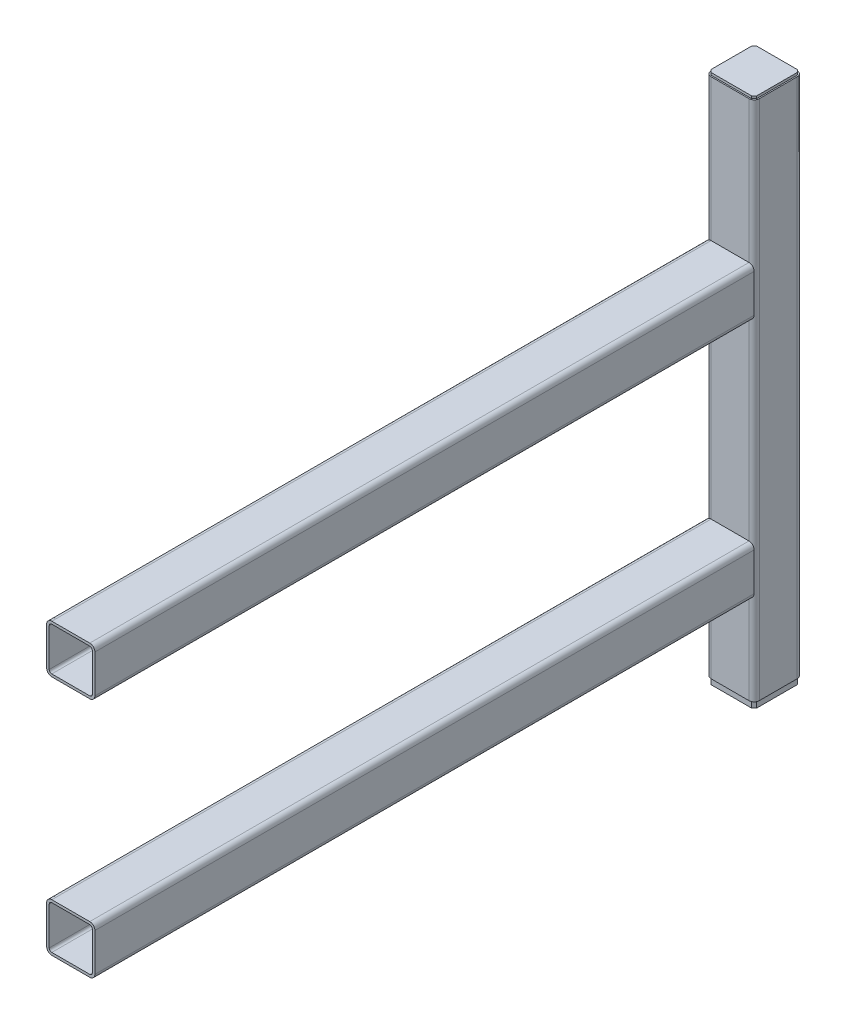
ISO-10303-21;
HEADER;
FILE_DESCRIPTION(('STEP AP214'),'2;1');
FILE_NAME('part.step','',(''),(''),'','','');
FILE_SCHEMA(('AUTOMOTIVE_DESIGN { 1 0 10303 214 1 1 1 1 }'));
ENDSEC;
DATA;
#1=APPLICATION_CONTEXT('core data for automotive mechanical design processes');
#2=APPLICATION_PROTOCOL_DEFINITION('international standard','automotive_design',2000,#1);
#3=PRODUCT_CONTEXT('',#1,'mechanical');
#4=PRODUCT('Part','Part','',(#3));
#5=PRODUCT_RELATED_PRODUCT_CATEGORY('part','',(#4));
#6=PRODUCT_DEFINITION_FORMATION('','',#4);
#7=PRODUCT_DEFINITION_CONTEXT('part definition',#1,'design');
#8=PRODUCT_DEFINITION('design','',#6,#7);
#9=PRODUCT_DEFINITION_SHAPE('','',#8);
#10=(LENGTH_UNIT() NAMED_UNIT(*) SI_UNIT(.MILLI.,.METRE.));
#11=(NAMED_UNIT(*) PLANE_ANGLE_UNIT() SI_UNIT($,.RADIAN.));
#12=(NAMED_UNIT(*) SI_UNIT($,.STERADIAN.) SOLID_ANGLE_UNIT());
#13=UNCERTAINTY_MEASURE_WITH_UNIT(LENGTH_MEASURE(1.E-05),#10,'distance_accuracy_value','');
#14=(GEOMETRIC_REPRESENTATION_CONTEXT(3) GLOBAL_UNCERTAINTY_ASSIGNED_CONTEXT((#13)) GLOBAL_UNIT_ASSIGNED_CONTEXT((#10,
#11,#12)) REPRESENTATION_CONTEXT('',''));
#15=CARTESIAN_POINT('',(0.,0.,0.));
#16=DIRECTION('',(0.,0.,1.));
#17=DIRECTION('',(1.,0.,0.));
#18=AXIS2_PLACEMENT_3D('',#15,#16,#17);
#19=CARTESIAN_POINT('',(25.4,656.51,28.4));
#20=DIRECTION('',(0.707106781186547,0.,0.707106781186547));
#21=DIRECTION('',(0.707106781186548,0.,-0.707106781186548));
#22=AXIS2_PLACEMENT_3D('',#19,#20,#21);
#23=PLANE('',#22);
#24=DIRECTION('',(0.707106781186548,0.,-0.707106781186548));
#25=VECTOR('',#24,1.);
#26=CARTESIAN_POINT('',(25.4,659.51,28.4));
#27=LINE('',#26,#25);
#28=CARTESIAN_POINT('',(25.4,659.51,28.4));
#29=VERTEX_POINT('',#28);
#30=CARTESIAN_POINT('',(28.4,659.51,25.4));
#31=VERTEX_POINT('',#30);
#32=EDGE_CURVE('E196',#29,#31,#27,.T.);
#33=ORIENTED_EDGE('',*,*,#32,.F.);
#34=DIRECTION('',(0.,1.,0.));
#35=VECTOR('',#34,1.);
#36=CARTESIAN_POINT('',(25.4,656.51,28.4));
#37=LINE('',#36,#35);
#38=CARTESIAN_POINT('',(25.4,656.51,28.4));
#39=VERTEX_POINT('',#38);
#40=EDGE_CURVE('E13',#39,#29,#37,.T.);
#41=ORIENTED_EDGE('',*,*,#40,.F.);
#42=DIRECTION('',(0.707106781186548,0.,-0.707106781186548));
#43=VECTOR('',#42,1.);
#44=CARTESIAN_POINT('',(25.4,656.51,28.4));
#45=LINE('',#44,#43);
#46=CARTESIAN_POINT('',(28.4,656.51,25.4));
#47=VERTEX_POINT('',#46);
#48=EDGE_CURVE('E216',#39,#47,#45,.T.);
#49=ORIENTED_EDGE('',*,*,#48,.T.);
#50=DIRECTION('',(0.,1.,0.));
#51=VECTOR('',#50,1.);
#52=CARTESIAN_POINT('',(28.4,656.51,25.4));
#53=LINE('',#52,#51);
#54=EDGE_CURVE('E102',#47,#31,#53,.T.);
#55=ORIENTED_EDGE('',*,*,#54,.T.);
#56=EDGE_LOOP('',(#33,#41,#49,#55));
#57=FACE_BOUND('',#56,.T.);
#58=ADVANCED_FACE('F99',(#57),#23,.T.);
#59=CARTESIAN_POINT('',(-25.4,656.51,28.4));
#60=DIRECTION('',(0.,0.,1.));
#61=DIRECTION('',(1.,0.,0.));
#62=AXIS2_PLACEMENT_3D('',#59,#60,#61);
#63=PLANE('',#62);
#64=DIRECTION('',(1.,0.,0.));
#65=VECTOR('',#64,1.);
#66=CARTESIAN_POINT('',(-25.4,659.51,28.4));
#67=LINE('',#66,#65);
#68=CARTESIAN_POINT('',(-25.4,659.51,28.4));
#69=VERTEX_POINT('',#68);
#70=EDGE_CURVE('E214',#69,#29,#67,.T.);
#71=ORIENTED_EDGE('',*,*,#70,.F.);
#72=DIRECTION('',(0.,1.,0.));
#73=VECTOR('',#72,1.);
#74=CARTESIAN_POINT('',(-25.4,656.51,28.4));
#75=LINE('',#74,#73);
#76=CARTESIAN_POINT('',(-25.4,656.51,28.4));
#77=VERTEX_POINT('',#76);
#78=EDGE_CURVE('E108',#77,#69,#75,.T.);
#79=ORIENTED_EDGE('',*,*,#78,.F.);
#80=DIRECTION('',(1.,0.,0.));
#81=VECTOR('',#80,1.);
#82=CARTESIAN_POINT('',(-25.4,656.51,28.4));
#83=LINE('',#82,#81);
#84=EDGE_CURVE('E186',#77,#39,#83,.T.);
#85=ORIENTED_EDGE('',*,*,#84,.T.);
#86=ORIENTED_EDGE('',*,*,#40,.T.);
#87=EDGE_LOOP('',(#71,#79,#85,#86));
#88=FACE_BOUND('',#87,.T.);
#89=ADVANCED_FACE('F228',(#88),#63,.T.);
#90=CARTESIAN_POINT('',(-28.4,656.51,25.4));
#91=DIRECTION('',(-0.707106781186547,0.,0.707106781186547));
#92=DIRECTION('',(0.707106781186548,0.,0.707106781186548));
#93=AXIS2_PLACEMENT_3D('',#90,#91,#92);
#94=PLANE('',#93);
#95=DIRECTION('',(0.707106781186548,0.,0.707106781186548));
#96=VECTOR('',#95,1.);
#97=CARTESIAN_POINT('',(-28.4,659.51,25.4));
#98=LINE('',#97,#96);
#99=CARTESIAN_POINT('',(-28.4,659.51,25.4));
#100=VERTEX_POINT('',#99);
#101=EDGE_CURVE('E173',#100,#69,#98,.T.);
#102=ORIENTED_EDGE('',*,*,#101,.F.);
#103=DIRECTION('',(0.,1.,0.));
#104=VECTOR('',#103,1.);
#105=CARTESIAN_POINT('',(-28.4,656.51,25.4));
#106=LINE('',#105,#104);
#107=CARTESIAN_POINT('',(-28.4,656.51,25.4));
#108=VERTEX_POINT('',#107);
#109=EDGE_CURVE('E168',#108,#100,#106,.T.);
#110=ORIENTED_EDGE('',*,*,#109,.F.);
#111=DIRECTION('',(0.707106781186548,0.,0.707106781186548));
#112=VECTOR('',#111,1.);
#113=CARTESIAN_POINT('',(-28.4,656.51,25.4));
#114=LINE('',#113,#112);
#115=EDGE_CURVE('E171',#108,#77,#114,.T.);
#116=ORIENTED_EDGE('',*,*,#115,.T.);
#117=ORIENTED_EDGE('',*,*,#78,.T.);
#118=EDGE_LOOP('',(#102,#110,#116,#117));
#119=FACE_BOUND('',#118,.T.);
#120=ADVANCED_FACE('F170',(#119),#94,.T.);
#121=CARTESIAN_POINT('',(-28.4,656.51,-25.4));
#122=DIRECTION('',(-1.,0.,0.));
#123=DIRECTION('',(0.,0.,1.));
#124=AXIS2_PLACEMENT_3D('',#121,#122,#123);
#125=PLANE('',#124);
#126=DIRECTION('',(0.,0.,1.));
#127=VECTOR('',#126,1.);
#128=CARTESIAN_POINT('',(-28.4,659.51,-25.4));
#129=LINE('',#128,#127);
#130=CARTESIAN_POINT('',(-28.4,659.51,-25.4));
#131=VERTEX_POINT('',#130);
#132=EDGE_CURVE('E211',#131,#100,#129,.T.);
#133=ORIENTED_EDGE('',*,*,#132,.F.);
#134=DIRECTION('',(0.,1.,0.));
#135=VECTOR('',#134,1.);
#136=CARTESIAN_POINT('',(-28.4,656.51,-25.4));
#137=LINE('',#136,#135);
#138=CARTESIAN_POINT('',(-28.4,656.51,-25.4));
#139=VERTEX_POINT('',#138);
#140=EDGE_CURVE('E178',#139,#131,#137,.T.);
#141=ORIENTED_EDGE('',*,*,#140,.F.);
#142=DIRECTION('',(0.,0.,1.));
#143=VECTOR('',#142,1.);
#144=CARTESIAN_POINT('',(-28.4,656.51,-25.4));
#145=LINE('',#144,#143);
#146=EDGE_CURVE('E184',#139,#108,#145,.T.);
#147=ORIENTED_EDGE('',*,*,#146,.T.);
#148=ORIENTED_EDGE('',*,*,#109,.T.);
#149=EDGE_LOOP('',(#133,#141,#147,#148));
#150=FACE_BOUND('',#149,.T.);
#151=ADVANCED_FACE('F188',(#150),#125,.T.);
#152=CARTESIAN_POINT('',(-25.4,656.51,-28.4));
#153=DIRECTION('',(-0.707106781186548,0.,-0.707106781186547));
#154=DIRECTION('',(-0.707106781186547,0.,0.707106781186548));
#155=AXIS2_PLACEMENT_3D('',#152,#153,#154);
#156=PLANE('',#155);
#157=DIRECTION('',(-0.707106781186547,0.,0.707106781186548));
#158=VECTOR('',#157,1.);
#159=CARTESIAN_POINT('',(-25.4,659.51,-28.4));
#160=LINE('',#159,#158);
#161=CARTESIAN_POINT('',(-25.4,659.51,-28.4));
#162=VERTEX_POINT('',#161);
#163=EDGE_CURVE('E208',#162,#131,#160,.T.);
#164=ORIENTED_EDGE('',*,*,#163,.F.);
#165=DIRECTION('',(0.,1.,0.));
#166=VECTOR('',#165,1.);
#167=CARTESIAN_POINT('',(-25.4,656.51,-28.4));
#168=LINE('',#167,#166);
#169=CARTESIAN_POINT('',(-25.4,656.51,-28.4));
#170=VERTEX_POINT('',#169);
#171=EDGE_CURVE('E220',#170,#162,#168,.T.);
#172=ORIENTED_EDGE('',*,*,#171,.F.);
#173=DIRECTION('',(-0.707106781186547,0.,0.707106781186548));
#174=VECTOR('',#173,1.);
#175=CARTESIAN_POINT('',(-25.4,656.51,-28.4));
#176=LINE('',#175,#174);
#177=EDGE_CURVE('E189',#170,#139,#176,.T.);
#178=ORIENTED_EDGE('',*,*,#177,.T.);
#179=ORIENTED_EDGE('',*,*,#140,.T.);
#180=EDGE_LOOP('',(#164,#172,#178,#179));
#181=FACE_BOUND('',#180,.T.);
#182=ADVANCED_FACE('F241',(#181),#156,.T.);
#183=CARTESIAN_POINT('',(25.4,656.51,-28.4));
#184=DIRECTION('',(0.,0.,-1.));
#185=DIRECTION('',(-1.,0.,0.));
#186=AXIS2_PLACEMENT_3D('',#183,#184,#185);
#187=PLANE('',#186);
#188=DIRECTION('',(-1.,0.,0.));
#189=VECTOR('',#188,1.);
#190=CARTESIAN_POINT('',(25.4,659.51,-28.4));
#191=LINE('',#190,#189);
#192=CARTESIAN_POINT('',(25.4,659.51,-28.4));
#193=VERTEX_POINT('',#192);
#194=EDGE_CURVE('E205',#193,#162,#191,.T.);
#195=ORIENTED_EDGE('',*,*,#194,.F.);
#196=DIRECTION('',(0.,1.,0.));
#197=VECTOR('',#196,1.);
#198=CARTESIAN_POINT('',(25.4,656.51,-28.4));
#199=LINE('',#198,#197);
#200=CARTESIAN_POINT('',(25.4,656.51,-28.4));
#201=VERTEX_POINT('',#200);
#202=EDGE_CURVE('E222',#201,#193,#199,.T.);
#203=ORIENTED_EDGE('',*,*,#202,.F.);
#204=DIRECTION('',(-1.,0.,0.));
#205=VECTOR('',#204,1.);
#206=CARTESIAN_POINT('',(25.4,656.51,-28.4));
#207=LINE('',#206,#205);
#208=EDGE_CURVE('E191',#201,#170,#207,.T.);
#209=ORIENTED_EDGE('',*,*,#208,.T.);
#210=ORIENTED_EDGE('',*,*,#171,.T.);
#211=EDGE_LOOP('',(#195,#203,#209,#210));
#212=FACE_BOUND('',#211,.T.);
#213=ADVANCED_FACE('F244',(#212),#187,.T.);
#214=CARTESIAN_POINT('',(28.4,656.51,-25.4));
#215=DIRECTION('',(0.707106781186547,0.,-0.707106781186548));
#216=DIRECTION('',(-0.707106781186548,0.,-0.707106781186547));
#217=AXIS2_PLACEMENT_3D('',#214,#215,#216);
#218=PLANE('',#217);
#219=DIRECTION('',(-0.707106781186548,0.,-0.707106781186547));
#220=VECTOR('',#219,1.);
#221=CARTESIAN_POINT('',(28.4,659.51,-25.4));
#222=LINE('',#221,#220);
#223=CARTESIAN_POINT('',(28.4,659.51,-25.4));
#224=VERTEX_POINT('',#223);
#225=EDGE_CURVE('E202',#224,#193,#222,.T.);
#226=ORIENTED_EDGE('',*,*,#225,.F.);
#227=DIRECTION('',(0.,1.,0.));
#228=VECTOR('',#227,1.);
#229=CARTESIAN_POINT('',(28.4,656.51,-25.4));
#230=LINE('',#229,#228);
#231=CARTESIAN_POINT('',(28.4,656.51,-25.4));
#232=VERTEX_POINT('',#231);
#233=EDGE_CURVE('E223',#232,#224,#230,.T.);
#234=ORIENTED_EDGE('',*,*,#233,.F.);
#235=DIRECTION('',(-0.707106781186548,0.,-0.707106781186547));
#236=VECTOR('',#235,1.);
#237=CARTESIAN_POINT('',(28.4,656.51,-25.4));
#238=LINE('',#237,#236);
#239=EDGE_CURVE('E319',#232,#201,#238,.T.);
#240=ORIENTED_EDGE('',*,*,#239,.T.);
#241=ORIENTED_EDGE('',*,*,#202,.T.);
#242=EDGE_LOOP('',(#226,#234,#240,#241));
#243=FACE_BOUND('',#242,.T.);
#244=ADVANCED_FACE('F248',(#243),#218,.T.);
#245=CARTESIAN_POINT('',(28.4,656.51,25.4));
#246=DIRECTION('',(1.,0.,0.));
#247=DIRECTION('',(0.,0.,-1.));
#248=AXIS2_PLACEMENT_3D('',#245,#246,#247);
#249=PLANE('',#248);
#250=DIRECTION('',(0.,0.,-1.));
#251=VECTOR('',#250,1.);
#252=CARTESIAN_POINT('',(28.4,659.51,25.4));
#253=LINE('',#252,#251);
#254=EDGE_CURVE('E199',#31,#224,#253,.T.);
#255=ORIENTED_EDGE('',*,*,#254,.F.);
#256=ORIENTED_EDGE('',*,*,#54,.F.);
#257=DIRECTION('',(0.,0.,-1.));
#258=VECTOR('',#257,1.);
#259=CARTESIAN_POINT('',(28.4,656.51,25.4));
#260=LINE('',#259,#258);
#261=EDGE_CURVE('E320',#47,#232,#260,.T.);
#262=ORIENTED_EDGE('',*,*,#261,.T.);
#263=ORIENTED_EDGE('',*,*,#233,.T.);
#264=EDGE_LOOP('',(#255,#256,#262,#263));
#265=FACE_BOUND('',#264,.T.);
#266=ADVANCED_FACE('F225',(#265),#249,.T.);
#267=CARTESIAN_POINT('',(53.8000000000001,656.51,0.));
#268=DIRECTION('',(0.,1.,0.));
#269=DIRECTION('',(0.,0.,1.));
#270=AXIS2_PLACEMENT_3D('',#267,#268,#269);
#271=PLANE('',#270);
#272=ORIENTED_EDGE('',*,*,#48,.F.);
#273=ORIENTED_EDGE('',*,*,#84,.F.);
#274=ORIENTED_EDGE('',*,*,#115,.F.);
#275=ORIENTED_EDGE('',*,*,#146,.F.);
#276=ORIENTED_EDGE('',*,*,#177,.F.);
#277=ORIENTED_EDGE('',*,*,#208,.F.);
#278=ORIENTED_EDGE('',*,*,#239,.F.);
#279=ORIENTED_EDGE('',*,*,#261,.F.);
#280=EDGE_LOOP('',(#272,#273,#274,#275,#276,#277,#278,#279));
#281=FACE_BOUND('',#280,.T.);
#282=ADVANCED_FACE('F182',(#281),#271,.F.);
#283=CARTESIAN_POINT('',(53.8000000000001,659.51,0.));
#284=DIRECTION('',(0.,1.,0.));
#285=DIRECTION('',(0.,0.,1.));
#286=AXIS2_PLACEMENT_3D('',#283,#284,#285);
#287=PLANE('',#286);
#288=ORIENTED_EDGE('',*,*,#32,.T.);
#289=ORIENTED_EDGE('',*,*,#254,.T.);
#290=ORIENTED_EDGE('',*,*,#225,.T.);
#291=ORIENTED_EDGE('',*,*,#194,.T.);
#292=ORIENTED_EDGE('',*,*,#163,.T.);
#293=ORIENTED_EDGE('',*,*,#132,.T.);
#294=ORIENTED_EDGE('',*,*,#101,.T.);
#295=ORIENTED_EDGE('',*,*,#70,.T.);
#296=EDGE_LOOP('',(#288,#289,#290,#291,#292,#293,#294,#295));
#297=FACE_BOUND('',#296,.T.);
#298=ADVANCED_FACE('F227',(#297),#287,.T.);
#299=CLOSED_SHELL('',(#58,#89,#120,#151,#182,#213,#244,#266,#282,#298));
#300=MANIFOLD_SOLID_BREP('B2',#299);
#301=CARTESIAN_POINT('',(28.4,8.,25.4));
#302=DIRECTION('',(0.707106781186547,0.,0.707106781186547));
#303=DIRECTION('',(0.707106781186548,0.,-0.707106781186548));
#304=AXIS2_PLACEMENT_3D('',#301,#302,#303);
#305=PLANE('',#304);
#306=DIRECTION('',(-0.707106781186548,0.,0.707106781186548));
#307=VECTOR('',#306,1.);
#308=CARTESIAN_POINT('',(28.4,0.,25.4));
#309=LINE('',#308,#307);
#310=CARTESIAN_POINT('',(28.4,0.,25.4));
#311=VERTEX_POINT('',#310);
#312=CARTESIAN_POINT('',(25.4,0.,28.4));
#313=VERTEX_POINT('',#312);
#314=EDGE_CURVE('E433',#311,#313,#309,.T.);
#315=ORIENTED_EDGE('',*,*,#314,.F.);
#316=DIRECTION('',(0.,-1.,0.));
#317=VECTOR('',#316,1.);
#318=CARTESIAN_POINT('',(28.4,8.,25.4));
#319=LINE('',#318,#317);
#320=CARTESIAN_POINT('',(28.4,8.,25.4));
#321=VERTEX_POINT('',#320);
#322=EDGE_CURVE('E97',#321,#311,#319,.T.);
#323=ORIENTED_EDGE('',*,*,#322,.F.);
#324=DIRECTION('',(-0.707106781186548,0.,0.707106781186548));
#325=VECTOR('',#324,1.);
#326=CARTESIAN_POINT('',(28.4,8.,25.4));
#327=LINE('',#326,#325);
#328=CARTESIAN_POINT('',(25.4,8.,28.4));
#329=VERTEX_POINT('',#328);
#330=EDGE_CURVE('E454',#321,#329,#327,.T.);
#331=ORIENTED_EDGE('',*,*,#330,.T.);
#332=DIRECTION('',(0.,-1.,0.));
#333=VECTOR('',#332,1.);
#334=CARTESIAN_POINT('',(25.4,8.,28.4));
#335=LINE('',#334,#333);
#336=EDGE_CURVE('E339',#329,#313,#335,.T.);
#337=ORIENTED_EDGE('',*,*,#336,.T.);
#338=EDGE_LOOP('',(#315,#323,#331,#337));
#339=FACE_BOUND('',#338,.T.);
#340=ADVANCED_FACE('F336',(#339),#305,.T.);
#341=CARTESIAN_POINT('',(28.4,8.,-25.4));
#342=DIRECTION('',(1.,0.,0.));
#343=DIRECTION('',(0.,0.,-1.));
#344=AXIS2_PLACEMENT_3D('',#341,#342,#343);
#345=PLANE('',#344);
#346=DIRECTION('',(0.,0.,1.));
#347=VECTOR('',#346,1.);
#348=CARTESIAN_POINT('',(28.4,0.,-25.4));
#349=LINE('',#348,#347);
#350=CARTESIAN_POINT('',(28.4,0.,-25.4));
#351=VERTEX_POINT('',#350);
#352=EDGE_CURVE('E452',#351,#311,#349,.T.);
#353=ORIENTED_EDGE('',*,*,#352,.F.);
#354=DIRECTION('',(0.,-1.,0.));
#355=VECTOR('',#354,1.);
#356=CARTESIAN_POINT('',(28.4,8.,-25.4));
#357=LINE('',#356,#355);
#358=CARTESIAN_POINT('',(28.4,8.,-25.4));
#359=VERTEX_POINT('',#358);
#360=EDGE_CURVE('E345',#359,#351,#357,.T.);
#361=ORIENTED_EDGE('',*,*,#360,.F.);
#362=DIRECTION('',(0.,0.,1.));
#363=VECTOR('',#362,1.);
#364=CARTESIAN_POINT('',(28.4,8.,-25.4));
#365=LINE('',#364,#363);
#366=EDGE_CURVE('E423',#359,#321,#365,.T.);
#367=ORIENTED_EDGE('',*,*,#366,.T.);
#368=ORIENTED_EDGE('',*,*,#322,.T.);
#369=EDGE_LOOP('',(#353,#361,#367,#368));
#370=FACE_BOUND('',#369,.T.);
#371=ADVANCED_FACE('F466',(#370),#345,.T.);
#372=CARTESIAN_POINT('',(25.4,8.,-28.4));
#373=DIRECTION('',(0.707106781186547,0.,-0.707106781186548));
#374=DIRECTION('',(-0.707106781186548,0.,-0.707106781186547));
#375=AXIS2_PLACEMENT_3D('',#372,#373,#374);
#376=PLANE('',#375);
#377=DIRECTION('',(0.707106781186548,0.,0.707106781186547));
#378=VECTOR('',#377,1.);
#379=CARTESIAN_POINT('',(25.4,0.,-28.4));
#380=LINE('',#379,#378);
#381=CARTESIAN_POINT('',(25.4,0.,-28.4));
#382=VERTEX_POINT('',#381);
#383=EDGE_CURVE('E410',#382,#351,#380,.T.);
#384=ORIENTED_EDGE('',*,*,#383,.F.);
#385=DIRECTION('',(0.,-1.,0.));
#386=VECTOR('',#385,1.);
#387=CARTESIAN_POINT('',(25.4,8.,-28.4));
#388=LINE('',#387,#386);
#389=CARTESIAN_POINT('',(25.4,8.,-28.4));
#390=VERTEX_POINT('',#389);
#391=EDGE_CURVE('E405',#390,#382,#388,.T.);
#392=ORIENTED_EDGE('',*,*,#391,.F.);
#393=DIRECTION('',(0.707106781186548,0.,0.707106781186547));
#394=VECTOR('',#393,1.);
#395=CARTESIAN_POINT('',(25.4,8.,-28.4));
#396=LINE('',#395,#394);
#397=EDGE_CURVE('E408',#390,#359,#396,.T.);
#398=ORIENTED_EDGE('',*,*,#397,.T.);
#399=ORIENTED_EDGE('',*,*,#360,.T.);
#400=EDGE_LOOP('',(#384,#392,#398,#399));
#401=FACE_BOUND('',#400,.T.);
#402=ADVANCED_FACE('F407',(#401),#376,.T.);
#403=CARTESIAN_POINT('',(-25.4,8.,-28.4));
#404=DIRECTION('',(0.,0.,-1.));
#405=DIRECTION('',(-1.,0.,0.));
#406=AXIS2_PLACEMENT_3D('',#403,#404,#405);
#407=PLANE('',#406);
#408=DIRECTION('',(1.,0.,0.));
#409=VECTOR('',#408,1.);
#410=CARTESIAN_POINT('',(-25.4,0.,-28.4));
#411=LINE('',#410,#409);
#412=CARTESIAN_POINT('',(-25.4,0.,-28.4));
#413=VERTEX_POINT('',#412);
#414=EDGE_CURVE('E449',#413,#382,#411,.T.);
#415=ORIENTED_EDGE('',*,*,#414,.F.);
#416=DIRECTION('',(0.,-1.,0.));
#417=VECTOR('',#416,1.);
#418=CARTESIAN_POINT('',(-25.4,8.,-28.4));
#419=LINE('',#418,#417);
#420=CARTESIAN_POINT('',(-25.4,8.,-28.4));
#421=VERTEX_POINT('',#420);
#422=EDGE_CURVE('E415',#421,#413,#419,.T.);
#423=ORIENTED_EDGE('',*,*,#422,.F.);
#424=DIRECTION('',(1.,0.,0.));
#425=VECTOR('',#424,1.);
#426=CARTESIAN_POINT('',(-25.4,8.,-28.4));
#427=LINE('',#426,#425);
#428=EDGE_CURVE('E421',#421,#390,#427,.T.);
#429=ORIENTED_EDGE('',*,*,#428,.T.);
#430=ORIENTED_EDGE('',*,*,#391,.T.);
#431=EDGE_LOOP('',(#415,#423,#429,#430));
#432=FACE_BOUND('',#431,.T.);
#433=ADVANCED_FACE('F425',(#432),#407,.T.);
#434=CARTESIAN_POINT('',(-28.4,8.,-25.4));
#435=DIRECTION('',(-0.707106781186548,0.,-0.707106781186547));
#436=DIRECTION('',(-0.707106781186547,0.,0.707106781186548));
#437=AXIS2_PLACEMENT_3D('',#434,#435,#436);
#438=PLANE('',#437);
#439=DIRECTION('',(0.707106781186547,0.,-0.707106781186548));
#440=VECTOR('',#439,1.);
#441=CARTESIAN_POINT('',(-28.4,0.,-25.4));
#442=LINE('',#441,#440);
#443=CARTESIAN_POINT('',(-28.4,0.,-25.4));
#444=VERTEX_POINT('',#443);
#445=EDGE_CURVE('E446',#444,#413,#442,.T.);
#446=ORIENTED_EDGE('',*,*,#445,.F.);
#447=DIRECTION('',(0.,-1.,0.));
#448=VECTOR('',#447,1.);
#449=CARTESIAN_POINT('',(-28.4,8.,-25.4));
#450=LINE('',#449,#448);
#451=CARTESIAN_POINT('',(-28.4,8.,-25.4));
#452=VERTEX_POINT('',#451);
#453=EDGE_CURVE('E458',#452,#444,#450,.T.);
#454=ORIENTED_EDGE('',*,*,#453,.F.);
#455=DIRECTION('',(0.707106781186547,0.,-0.707106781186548));
#456=VECTOR('',#455,1.);
#457=CARTESIAN_POINT('',(-28.4,8.,-25.4));
#458=LINE('',#457,#456);
#459=EDGE_CURVE('E426',#452,#421,#458,.T.);
#460=ORIENTED_EDGE('',*,*,#459,.T.);
#461=ORIENTED_EDGE('',*,*,#422,.T.);
#462=EDGE_LOOP('',(#446,#454,#460,#461));
#463=FACE_BOUND('',#462,.T.);
#464=ADVANCED_FACE('F479',(#463),#438,.T.);
#465=CARTESIAN_POINT('',(-28.4,8.,25.4));
#466=DIRECTION('',(-1.,0.,0.));
#467=DIRECTION('',(0.,0.,1.));
#468=AXIS2_PLACEMENT_3D('',#465,#466,#467);
#469=PLANE('',#468);
#470=DIRECTION('',(0.,0.,-1.));
#471=VECTOR('',#470,1.);
#472=CARTESIAN_POINT('',(-28.4,0.,25.4));
#473=LINE('',#472,#471);
#474=CARTESIAN_POINT('',(-28.4,0.,25.4));
#475=VERTEX_POINT('',#474);
#476=EDGE_CURVE('E443',#475,#444,#473,.T.);
#477=ORIENTED_EDGE('',*,*,#476,.F.);
#478=DIRECTION('',(0.,-1.,0.));
#479=VECTOR('',#478,1.);
#480=CARTESIAN_POINT('',(-28.4,8.,25.4));
#481=LINE('',#480,#479);
#482=CARTESIAN_POINT('',(-28.4,8.,25.4));
#483=VERTEX_POINT('',#482);
#484=EDGE_CURVE('E460',#483,#475,#481,.T.);
#485=ORIENTED_EDGE('',*,*,#484,.F.);
#486=DIRECTION('',(0.,0.,-1.));
#487=VECTOR('',#486,1.);
#488=CARTESIAN_POINT('',(-28.4,8.,25.4));
#489=LINE('',#488,#487);
#490=EDGE_CURVE('E428',#483,#452,#489,.T.);
#491=ORIENTED_EDGE('',*,*,#490,.T.);
#492=ORIENTED_EDGE('',*,*,#453,.T.);
#493=EDGE_LOOP('',(#477,#485,#491,#492));
#494=FACE_BOUND('',#493,.T.);
#495=ADVANCED_FACE('F482',(#494),#469,.T.);
#496=CARTESIAN_POINT('',(-25.4,8.,28.4));
#497=DIRECTION('',(-0.707106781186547,0.,0.707106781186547));
#498=DIRECTION('',(0.707106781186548,0.,0.707106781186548));
#499=AXIS2_PLACEMENT_3D('',#496,#497,#498);
#500=PLANE('',#499);
#501=DIRECTION('',(-0.707106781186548,0.,-0.707106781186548));
#502=VECTOR('',#501,1.);
#503=CARTESIAN_POINT('',(-25.4,0.,28.4));
#504=LINE('',#503,#502);
#505=CARTESIAN_POINT('',(-25.4,0.,28.4));
#506=VERTEX_POINT('',#505);
#507=EDGE_CURVE('E440',#506,#475,#504,.T.);
#508=ORIENTED_EDGE('',*,*,#507,.F.);
#509=DIRECTION('',(0.,-1.,0.));
#510=VECTOR('',#509,1.);
#511=CARTESIAN_POINT('',(-25.4,8.,28.4));
#512=LINE('',#511,#510);
#513=CARTESIAN_POINT('',(-25.4,8.,28.4));
#514=VERTEX_POINT('',#513);
#515=EDGE_CURVE('E461',#514,#506,#512,.T.);
#516=ORIENTED_EDGE('',*,*,#515,.F.);
#517=DIRECTION('',(-0.707106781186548,0.,-0.707106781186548));
#518=VECTOR('',#517,1.);
#519=CARTESIAN_POINT('',(-25.4,8.,28.4));
#520=LINE('',#519,#518);
#521=EDGE_CURVE('E517',#514,#483,#520,.T.);
#522=ORIENTED_EDGE('',*,*,#521,.T.);
#523=ORIENTED_EDGE('',*,*,#484,.T.);
#524=EDGE_LOOP('',(#508,#516,#522,#523));
#525=FACE_BOUND('',#524,.T.);
#526=ADVANCED_FACE('F486',(#525),#500,.T.);
#527=CARTESIAN_POINT('',(25.4,8.,28.4));
#528=DIRECTION('',(0.,0.,1.));
#529=DIRECTION('',(1.,0.,0.));
#530=AXIS2_PLACEMENT_3D('',#527,#528,#529);
#531=PLANE('',#530);
#532=DIRECTION('',(-1.,0.,0.));
#533=VECTOR('',#532,1.);
#534=CARTESIAN_POINT('',(25.4,0.,28.4));
#535=LINE('',#534,#533);
#536=EDGE_CURVE('E436',#313,#506,#535,.T.);
#537=ORIENTED_EDGE('',*,*,#536,.F.);
#538=ORIENTED_EDGE('',*,*,#336,.F.);
#539=DIRECTION('',(-1.,0.,0.));
#540=VECTOR('',#539,1.);
#541=CARTESIAN_POINT('',(25.4,8.,28.4));
#542=LINE('',#541,#540);
#543=EDGE_CURVE('E515',#329,#514,#542,.T.);
#544=ORIENTED_EDGE('',*,*,#543,.T.);
#545=ORIENTED_EDGE('',*,*,#515,.T.);
#546=EDGE_LOOP('',(#537,#538,#544,#545));
#547=FACE_BOUND('',#546,.T.);
#548=ADVANCED_FACE('F463',(#547),#531,.T.);
#549=CARTESIAN_POINT('',(0.,8.,53.8));
#550=DIRECTION('',(0.,-1.,0.));
#551=DIRECTION('',(0.,0.,-1.));
#552=AXIS2_PLACEMENT_3D('',#549,#550,#551);
#553=PLANE('',#552);
#554=CARTESIAN_POINT('',(0.,8.,0.));
#555=DIRECTION('',(0.,-1.,0.));
#556=DIRECTION('',(0.,0.,-1.));
#557=AXIS2_PLACEMENT_3D('',#554,#555,#556);
#558=CIRCLE('',#557,5.09999999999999);
#559=CARTESIAN_POINT('',(0.,8.,-5.09999999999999));
#560=VERTEX_POINT('',#559);
#561=EDGE_CURVE('E437',#560,#560,#558,.T.);
#562=ORIENTED_EDGE('',*,*,#561,.T.);
#563=EDGE_LOOP('',(#562));
#564=FACE_BOUND('',#563,.T.);
#565=ORIENTED_EDGE('',*,*,#330,.F.);
#566=ORIENTED_EDGE('',*,*,#366,.F.);
#567=ORIENTED_EDGE('',*,*,#397,.F.);
#568=ORIENTED_EDGE('',*,*,#428,.F.);
#569=ORIENTED_EDGE('',*,*,#459,.F.);
#570=ORIENTED_EDGE('',*,*,#490,.F.);
#571=ORIENTED_EDGE('',*,*,#521,.F.);
#572=ORIENTED_EDGE('',*,*,#543,.F.);
#573=EDGE_LOOP('',(#565,#566,#567,#568,#569,#570,#571,#572));
#574=FACE_BOUND('',#573,.T.);
#575=ADVANCED_FACE('F419',(#564,#574),#553,.F.);
#576=CARTESIAN_POINT('',(0.,0.,53.8));
#577=DIRECTION('',(0.,-1.,0.));
#578=DIRECTION('',(0.,0.,-1.));
#579=AXIS2_PLACEMENT_3D('',#576,#577,#578);
#580=PLANE('',#579);
#581=CARTESIAN_POINT('',(0.,0.,0.));
#582=DIRECTION('',(0.,-1.,0.));
#583=DIRECTION('',(0.,0.,-1.));
#584=AXIS2_PLACEMENT_3D('',#581,#582,#583);
#585=CIRCLE('',#584,5.1);
#586=CARTESIAN_POINT('',(0.,0.,-5.1));
#587=VERTEX_POINT('',#586);
#588=EDGE_CURVE('E509',#587,#587,#585,.T.);
#589=ORIENTED_EDGE('',*,*,#588,.F.);
#590=EDGE_LOOP('',(#589));
#591=FACE_BOUND('',#590,.T.);
#592=ORIENTED_EDGE('',*,*,#314,.T.);
#593=ORIENTED_EDGE('',*,*,#536,.T.);
#594=ORIENTED_EDGE('',*,*,#507,.T.);
#595=ORIENTED_EDGE('',*,*,#476,.T.);
#596=ORIENTED_EDGE('',*,*,#445,.T.);
#597=ORIENTED_EDGE('',*,*,#414,.T.);
#598=ORIENTED_EDGE('',*,*,#383,.T.);
#599=ORIENTED_EDGE('',*,*,#352,.T.);
#600=EDGE_LOOP('',(#592,#593,#594,#595,#596,#597,#598,#599));
#601=FACE_BOUND('',#600,.T.);
#602=ADVANCED_FACE('F465',(#591,#601),#580,.T.);
#603=CARTESIAN_POINT('',(0.,0.,0.));
#604=DIRECTION('',(0.,-1.,0.));
#605=DIRECTION('',(0.,0.,-1.));
#606=AXIS2_PLACEMENT_3D('',#603,#604,#605);
#607=CYLINDRICAL_SURFACE('',#606,5.09999999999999);
#608=ORIENTED_EDGE('',*,*,#588,.T.);
#609=EDGE_LOOP('',(#608));
#610=FACE_BOUND('',#609,.T.);
#611=ORIENTED_EDGE('',*,*,#561,.F.);
#612=EDGE_LOOP('',(#611));
#613=FACE_BOUND('',#612,.T.);
#614=ADVANCED_FACE('F498',(#610,#613),#607,.F.);
#615=CLOSED_SHELL('',(#340,#371,#402,#433,#464,#495,#526,#548,#575,#602,#614));
#616=MANIFOLD_SOLID_BREP('B7',#615);
#617=CARTESIAN_POINT('',(23.6,126.4,850.));
#618=DIRECTION('',(0.,0.,-1.));
#619=DIRECTION('',(0.,1.,0.));
#620=AXIS2_PLACEMENT_3D('',#617,#618,#619);
#621=CYLINDRICAL_SURFACE('',#620,6.40000000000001);
#622=CARTESIAN_POINT('',(23.6,126.4,30.));
#623=DIRECTION('',(0.,0.,-1.));
#624=DIRECTION('',(-1.,0.,0.));
#625=AXIS2_PLACEMENT_3D('',#622,#623,#624);
#626=CIRCLE('',#625,6.40000000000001);
#627=CARTESIAN_POINT('',(30.,126.4,30.));
#628=VERTEX_POINT('',#627);
#629=CARTESIAN_POINT('',(23.6,120.,30.));
#630=VERTEX_POINT('',#629);
#631=EDGE_CURVE('E772',#628,#630,#626,.T.);
#632=ORIENTED_EDGE('',*,*,#631,.F.);
#633=DIRECTION('',(0.,0.,-1.));
#634=VECTOR('',#633,1.);
#635=CARTESIAN_POINT('',(30.,126.4,850.));
#636=LINE('',#635,#634);
#637=CARTESIAN_POINT('',(30.,126.4,850.));
#638=VERTEX_POINT('',#637);
#639=EDGE_CURVE('E694',#638,#628,#636,.T.);
#640=ORIENTED_EDGE('',*,*,#639,.F.);
#641=CARTESIAN_POINT('',(23.6,126.4,850.));
#642=DIRECTION('',(0.,0.,1.));
#643=DIRECTION('',(0.,-1.,0.));
#644=AXIS2_PLACEMENT_3D('',#641,#642,#643);
#645=CIRCLE('',#644,6.40000000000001);
#646=CARTESIAN_POINT('',(23.6,120.,850.));
#647=VERTEX_POINT('',#646);
#648=EDGE_CURVE('E689',#647,#638,#645,.T.);
#649=ORIENTED_EDGE('',*,*,#648,.F.);
#650=DIRECTION('',(0.,0.,-1.));
#651=VECTOR('',#650,1.);
#652=CARTESIAN_POINT('',(23.6,120.,850.));
#653=LINE('',#652,#651);
#654=EDGE_CURVE('E691',#647,#630,#653,.T.);
#655=ORIENTED_EDGE('',*,*,#654,.T.);
#656=EDGE_LOOP('',(#632,#640,#649,#655));
#657=FACE_BOUND('',#656,.T.);
#658=ADVANCED_FACE('F598',(#657),#621,.T.);
#659=CARTESIAN_POINT('',(30.,126.4,850.));
#660=DIRECTION('',(-1.,0.,0.));
#661=DIRECTION('',(0.,-1.,0.));
#662=AXIS2_PLACEMENT_3D('',#659,#660,#661);
#663=PLANE('',#662);
#664=DIRECTION('',(0.,-1.,0.));
#665=VECTOR('',#664,1.);
#666=CARTESIAN_POINT('',(30.,659.51,30.));
#667=LINE('',#666,#665);
#668=CARTESIAN_POINT('',(30.,173.6,30.));
#669=VERTEX_POINT('',#668);
#670=EDGE_CURVE('E757',#669,#628,#667,.T.);
#671=ORIENTED_EDGE('',*,*,#670,.F.);
#672=DIRECTION('',(0.,0.,-1.));
#673=VECTOR('',#672,1.);
#674=CARTESIAN_POINT('',(30.,173.6,850.));
#675=LINE('',#674,#673);
#676=CARTESIAN_POINT('',(30.,173.6,850.));
#677=VERTEX_POINT('',#676);
#678=EDGE_CURVE('E780',#677,#669,#675,.T.);
#679=ORIENTED_EDGE('',*,*,#678,.F.);
#680=DIRECTION('',(0.,1.,0.));
#681=VECTOR('',#680,1.);
#682=CARTESIAN_POINT('',(30.,126.4,850.));
#683=LINE('',#682,#681);
#684=EDGE_CURVE('E864',#638,#677,#683,.T.);
#685=ORIENTED_EDGE('',*,*,#684,.F.);
#686=ORIENTED_EDGE('',*,*,#639,.T.);
#687=EDGE_LOOP('',(#671,#679,#685,#686));
#688=FACE_BOUND('',#687,.T.);
#689=ADVANCED_FACE('F851',(#688),#663,.F.);
#690=CARTESIAN_POINT('',(23.6,173.6,850.));
#691=DIRECTION('',(0.,0.,-1.));
#692=DIRECTION('',(0.,1.,0.));
#693=AXIS2_PLACEMENT_3D('',#690,#691,#692);
#694=CYLINDRICAL_SURFACE('',#693,6.40000000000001);
#695=CARTESIAN_POINT('',(23.6,173.6,30.));
#696=DIRECTION('',(0.,0.,-1.));
#697=DIRECTION('',(-1.,0.,0.));
#698=AXIS2_PLACEMENT_3D('',#695,#696,#697);
#699=CIRCLE('',#698,6.40000000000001);
#700=CARTESIAN_POINT('',(23.6,180.,30.));
#701=VERTEX_POINT('',#700);
#702=EDGE_CURVE('E756',#701,#669,#699,.T.);
#703=ORIENTED_EDGE('',*,*,#702,.F.);
#704=DIRECTION('',(0.,0.,-1.));
#705=VECTOR('',#704,1.);
#706=CARTESIAN_POINT('',(23.6,180.,850.));
#707=LINE('',#706,#705);
#708=CARTESIAN_POINT('',(23.6,180.,850.));
#709=VERTEX_POINT('',#708);
#710=EDGE_CURVE('E782',#709,#701,#707,.T.);
#711=ORIENTED_EDGE('',*,*,#710,.F.);
#712=CARTESIAN_POINT('',(23.6,173.6,850.));
#713=DIRECTION('',(0.,0.,1.));
#714=DIRECTION('',(0.,-1.,0.));
#715=AXIS2_PLACEMENT_3D('',#712,#713,#714);
#716=CIRCLE('',#715,6.40000000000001);
#717=EDGE_CURVE('E796',#677,#709,#716,.T.);
#718=ORIENTED_EDGE('',*,*,#717,.F.);
#719=ORIENTED_EDGE('',*,*,#678,.T.);
#720=EDGE_LOOP('',(#703,#711,#718,#719));
#721=FACE_BOUND('',#720,.T.);
#722=ADVANCED_FACE('F793',(#721),#694,.T.);
#723=CARTESIAN_POINT('',(-23.6,180.,850.));
#724=DIRECTION('',(0.,-1.,0.));
#725=DIRECTION('',(1.,0.,0.));
#726=AXIS2_PLACEMENT_3D('',#723,#724,#725);
#727=PLANE('',#726);
#728=DIRECTION('',(1.,0.,0.));
#729=VECTOR('',#728,1.);
#730=CARTESIAN_POINT('',(-23.6,180.,30.));
#731=LINE('',#730,#729);
#732=CARTESIAN_POINT('',(-23.6,180.,30.));
#733=VERTEX_POINT('',#732);
#734=EDGE_CURVE('E334',#733,#701,#731,.T.);
#735=ORIENTED_EDGE('',*,*,#734,.F.);
#736=DIRECTION('',(0.,0.,-1.));
#737=VECTOR('',#736,1.);
#738=CARTESIAN_POINT('',(-23.6,180.,850.));
#739=LINE('',#738,#737);
#740=CARTESIAN_POINT('',(-23.6,180.,850.));
#741=VERTEX_POINT('',#740);
#742=EDGE_CURVE('E666',#741,#733,#739,.T.);
#743=ORIENTED_EDGE('',*,*,#742,.F.);
#744=DIRECTION('',(-1.,0.,0.));
#745=VECTOR('',#744,1.);
#746=CARTESIAN_POINT('',(-23.6,180.,850.));
#747=LINE('',#746,#745);
#748=EDGE_CURVE('E790',#709,#741,#747,.T.);
#749=ORIENTED_EDGE('',*,*,#748,.F.);
#750=ORIENTED_EDGE('',*,*,#710,.T.);
#751=EDGE_LOOP('',(#735,#743,#749,#750));
#752=FACE_BOUND('',#751,.T.);
#753=ADVANCED_FACE('F787',(#752),#727,.F.);
#754=CARTESIAN_POINT('',(-23.6,173.6,850.));
#755=DIRECTION('',(0.,0.,-1.));
#756=DIRECTION('',(0.,1.,0.));
#757=AXIS2_PLACEMENT_3D('',#754,#755,#756);
#758=CYLINDRICAL_SURFACE('',#757,6.39999999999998);
#759=CARTESIAN_POINT('',(-23.6,173.6,30.));
#760=DIRECTION('',(0.,0.,-1.));
#761=DIRECTION('',(-1.,0.,0.));
#762=AXIS2_PLACEMENT_3D('',#759,#760,#761);
#763=CIRCLE('',#762,6.39999999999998);
#764=CARTESIAN_POINT('',(-30.,173.600000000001,30.));
#765=VERTEX_POINT('',#764);
#766=EDGE_CURVE('E607',#765,#733,#763,.T.);
#767=ORIENTED_EDGE('',*,*,#766,.F.);
#768=DIRECTION('',(0.,0.,-1.));
#769=VECTOR('',#768,1.);
#770=CARTESIAN_POINT('',(-30.,173.6,850.));
#771=LINE('',#770,#769);
#772=CARTESIAN_POINT('',(-30.,173.6,850.));
#773=VERTEX_POINT('',#772);
#774=EDGE_CURVE('E665',#773,#765,#771,.T.);
#775=ORIENTED_EDGE('',*,*,#774,.F.);
#776=CARTESIAN_POINT('',(-23.6,173.6,850.));
#777=DIRECTION('',(0.,0.,1.));
#778=DIRECTION('',(0.,-1.,0.));
#779=AXIS2_PLACEMENT_3D('',#776,#777,#778);
#780=CIRCLE('',#779,6.39999999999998);
#781=EDGE_CURVE('E873',#741,#773,#780,.T.);
#782=ORIENTED_EDGE('',*,*,#781,.F.);
#783=ORIENTED_EDGE('',*,*,#742,.T.);
#784=EDGE_LOOP('',(#767,#775,#782,#783));
#785=FACE_BOUND('',#784,.T.);
#786=ADVANCED_FACE('F671',(#785),#758,.T.);
#787=CARTESIAN_POINT('',(-30.,173.6,850.));
#788=DIRECTION('',(1.,0.,0.));
#789=DIRECTION('',(0.,1.,0.));
#790=AXIS2_PLACEMENT_3D('',#787,#788,#789);
#791=PLANE('',#790);
#792=DIRECTION('',(0.,-1.,0.));
#793=VECTOR('',#792,1.);
#794=CARTESIAN_POINT('',(-30.,659.51,30.));
#795=LINE('',#794,#793);
#796=CARTESIAN_POINT('',(-30.,126.4,30.));
#797=VERTEX_POINT('',#796);
#798=EDGE_CURVE('E658',#765,#797,#795,.T.);
#799=ORIENTED_EDGE('',*,*,#798,.T.);
#800=DIRECTION('',(0.,0.,-1.));
#801=VECTOR('',#800,1.);
#802=CARTESIAN_POINT('',(-30.,126.4,850.));
#803=LINE('',#802,#801);
#804=CARTESIAN_POINT('',(-30.,126.4,850.));
#805=VERTEX_POINT('',#804);
#806=EDGE_CURVE('E680',#805,#797,#803,.T.);
#807=ORIENTED_EDGE('',*,*,#806,.F.);
#808=DIRECTION('',(0.,-1.,0.));
#809=VECTOR('',#808,1.);
#810=CARTESIAN_POINT('',(-30.,173.6,850.));
#811=LINE('',#810,#809);
#812=EDGE_CURVE('E679',#773,#805,#811,.T.);
#813=ORIENTED_EDGE('',*,*,#812,.F.);
#814=ORIENTED_EDGE('',*,*,#774,.T.);
#815=EDGE_LOOP('',(#799,#807,#813,#814));
#816=FACE_BOUND('',#815,.T.);
#817=ADVANCED_FACE('F677',(#816),#791,.F.);
#818=CARTESIAN_POINT('',(-23.6,126.4,850.));
#819=DIRECTION('',(0.,0.,-1.));
#820=DIRECTION('',(0.,1.,0.));
#821=AXIS2_PLACEMENT_3D('',#818,#819,#820);
#822=CYLINDRICAL_SURFACE('',#821,6.40000000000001);
#823=CARTESIAN_POINT('',(-23.6,126.4,30.));
#824=DIRECTION('',(0.,0.,-1.));
#825=DIRECTION('',(-1.,0.,0.));
#826=AXIS2_PLACEMENT_3D('',#823,#824,#825);
#827=CIRCLE('',#826,6.40000000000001);
#828=CARTESIAN_POINT('',(-23.6,120.,30.));
#829=VERTEX_POINT('',#828);
#830=EDGE_CURVE('E656',#829,#797,#827,.T.);
#831=ORIENTED_EDGE('',*,*,#830,.F.);
#832=DIRECTION('',(0.,0.,-1.));
#833=VECTOR('',#832,1.);
#834=CARTESIAN_POINT('',(-23.6,120.,850.));
#835=LINE('',#834,#833);
#836=CARTESIAN_POINT('',(-23.6,120.,850.));
#837=VERTEX_POINT('',#836);
#838=EDGE_CURVE('E686',#837,#829,#835,.T.);
#839=ORIENTED_EDGE('',*,*,#838,.F.);
#840=CARTESIAN_POINT('',(-23.6,126.4,850.));
#841=DIRECTION('',(0.,0.,1.));
#842=DIRECTION('',(0.,-1.,0.));
#843=AXIS2_PLACEMENT_3D('',#840,#841,#842);
#844=CIRCLE('',#843,6.40000000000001);
#845=EDGE_CURVE('E877',#805,#837,#844,.T.);
#846=ORIENTED_EDGE('',*,*,#845,.F.);
#847=ORIENTED_EDGE('',*,*,#806,.T.);
#848=EDGE_LOOP('',(#831,#839,#846,#847));
#849=FACE_BOUND('',#848,.T.);
#850=ADVANCED_FACE('F848',(#849),#822,.T.);
#851=CARTESIAN_POINT('',(23.6,173.6,850.));
#852=DIRECTION('',(0.,0.,-1.));
#853=DIRECTION('',(0.,1.,0.));
#854=AXIS2_PLACEMENT_3D('',#851,#852,#853);
#855=CYLINDRICAL_SURFACE('',#854,3.2);
#856=DIRECTION('',(0.,0.,-1.));
#857=VECTOR('',#856,1.);
#858=CARTESIAN_POINT('',(23.6,176.8,850.));
#859=LINE('',#858,#857);
#860=CARTESIAN_POINT('',(23.6,176.8,850.));
#861=VERTEX_POINT('',#860);
#862=CARTESIAN_POINT('',(23.6,176.8,30.));
#863=VERTEX_POINT('',#862);
#864=EDGE_CURVE('E601',#861,#863,#859,.T.);
#865=ORIENTED_EDGE('',*,*,#864,.T.);
#866=CARTESIAN_POINT('',(23.6,173.6,30.));
#867=DIRECTION('',(0.,0.,-1.));
#868=DIRECTION('',(-1.,0.,0.));
#869=AXIS2_PLACEMENT_3D('',#866,#867,#868);
#870=CIRCLE('',#869,3.2);
#871=CARTESIAN_POINT('',(26.8,173.600000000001,30.));
#872=VERTEX_POINT('',#871);
#873=EDGE_CURVE('E755',#863,#872,#870,.T.);
#874=ORIENTED_EDGE('',*,*,#873,.T.);
#875=DIRECTION('',(0.,0.,-1.));
#876=VECTOR('',#875,1.);
#877=CARTESIAN_POINT('',(26.8,173.6,850.));
#878=LINE('',#877,#876);
#879=CARTESIAN_POINT('',(26.8,173.6,850.));
#880=VERTEX_POINT('',#879);
#881=EDGE_CURVE('E695',#880,#872,#878,.T.);
#882=ORIENTED_EDGE('',*,*,#881,.F.);
#883=CARTESIAN_POINT('',(23.6,173.6,850.));
#884=DIRECTION('',(0.,0.,1.));
#885=DIRECTION('',(0.,-1.,0.));
#886=AXIS2_PLACEMENT_3D('',#883,#884,#885);
#887=CIRCLE('',#886,3.2);
#888=EDGE_CURVE('E699',#880,#861,#887,.T.);
#889=ORIENTED_EDGE('',*,*,#888,.T.);
#890=EDGE_LOOP('',(#865,#874,#882,#889));
#891=FACE_BOUND('',#890,.T.);
#892=ADVANCED_FACE('F831',(#891),#855,.F.);
#893=CARTESIAN_POINT('',(26.8,126.4,850.));
#894=DIRECTION('',(-1.,0.,0.));
#895=DIRECTION('',(0.,-1.,0.));
#896=AXIS2_PLACEMENT_3D('',#893,#894,#895);
#897=PLANE('',#896);
#898=ORIENTED_EDGE('',*,*,#881,.T.);
#899=DIRECTION('',(0.,-1.,0.));
#900=VECTOR('',#899,1.);
#901=CARTESIAN_POINT('',(26.8,126.4,30.));
#902=LINE('',#901,#900);
#903=CARTESIAN_POINT('',(26.8,126.4,30.));
#904=VERTEX_POINT('',#903);
#905=EDGE_CURVE('E698',#872,#904,#902,.T.);
#906=ORIENTED_EDGE('',*,*,#905,.T.);
#907=DIRECTION('',(0.,0.,-1.));
#908=VECTOR('',#907,1.);
#909=CARTESIAN_POINT('',(26.8,126.4,850.));
#910=LINE('',#909,#908);
#911=CARTESIAN_POINT('',(26.8,126.4,850.));
#912=VERTEX_POINT('',#911);
#913=EDGE_CURVE('E700',#912,#904,#910,.T.);
#914=ORIENTED_EDGE('',*,*,#913,.F.);
#915=DIRECTION('',(0.,1.,0.));
#916=VECTOR('',#915,1.);
#917=CARTESIAN_POINT('',(26.8,126.4,850.));
#918=LINE('',#917,#916);
#919=EDGE_CURVE('E704',#912,#880,#918,.T.);
#920=ORIENTED_EDGE('',*,*,#919,.T.);
#921=EDGE_LOOP('',(#898,#906,#914,#920));
#922=FACE_BOUND('',#921,.T.);
#923=ADVANCED_FACE('F837',(#922),#897,.T.);
#924=CARTESIAN_POINT('',(23.6,126.4,850.));
#925=DIRECTION('',(0.,0.,-1.));
#926=DIRECTION('',(0.,1.,0.));
#927=AXIS2_PLACEMENT_3D('',#924,#925,#926);
#928=CYLINDRICAL_SURFACE('',#927,3.2);
#929=ORIENTED_EDGE('',*,*,#913,.T.);
#930=CARTESIAN_POINT('',(23.6,126.4,30.));
#931=DIRECTION('',(0.,0.,-1.));
#932=DIRECTION('',(-1.,0.,0.));
#933=AXIS2_PLACEMENT_3D('',#930,#931,#932);
#934=CIRCLE('',#933,3.2);
#935=CARTESIAN_POINT('',(23.6,123.2,30.));
#936=VERTEX_POINT('',#935);
#937=EDGE_CURVE('E703',#904,#936,#934,.T.);
#938=ORIENTED_EDGE('',*,*,#937,.T.);
#939=DIRECTION('',(0.,0.,-1.));
#940=VECTOR('',#939,1.);
#941=CARTESIAN_POINT('',(23.6,123.2,850.));
#942=LINE('',#941,#940);
#943=CARTESIAN_POINT('',(23.6,123.2,850.));
#944=VERTEX_POINT('',#943);
#945=EDGE_CURVE('E705',#944,#936,#942,.T.);
#946=ORIENTED_EDGE('',*,*,#945,.F.);
#947=CARTESIAN_POINT('',(23.6,126.4,850.));
#948=DIRECTION('',(0.,0.,1.));
#949=DIRECTION('',(0.,-1.,0.));
#950=AXIS2_PLACEMENT_3D('',#947,#948,#949);
#951=CIRCLE('',#950,3.2);
#952=EDGE_CURVE('E709',#944,#912,#951,.T.);
#953=ORIENTED_EDGE('',*,*,#952,.T.);
#954=EDGE_LOOP('',(#929,#938,#946,#953));
#955=FACE_BOUND('',#954,.T.);
#956=ADVANCED_FACE('F839',(#955),#928,.F.);
#957=CARTESIAN_POINT('',(23.6,123.2,850.));
#958=DIRECTION('',(0.,1.,0.));
#959=DIRECTION('',(0.,0.,1.));
#960=AXIS2_PLACEMENT_3D('',#957,#958,#959);
#961=PLANE('',#960);
#962=ORIENTED_EDGE('',*,*,#945,.T.);
#963=DIRECTION('',(-1.,0.,0.));
#964=VECTOR('',#963,1.);
#965=CARTESIAN_POINT('',(23.6,123.2,30.));
#966=LINE('',#965,#964);
#967=CARTESIAN_POINT('',(-23.6,123.2,30.));
#968=VERTEX_POINT('',#967);
#969=EDGE_CURVE('E708',#936,#968,#966,.T.);
#970=ORIENTED_EDGE('',*,*,#969,.T.);
#971=DIRECTION('',(0.,0.,-1.));
#972=VECTOR('',#971,1.);
#973=CARTESIAN_POINT('',(-23.6,123.2,850.));
#974=LINE('',#973,#972);
#975=CARTESIAN_POINT('',(-23.6,123.2,850.));
#976=VERTEX_POINT('',#975);
#977=EDGE_CURVE('E710',#976,#968,#974,.T.);
#978=ORIENTED_EDGE('',*,*,#977,.F.);
#979=DIRECTION('',(1.,0.,0.));
#980=VECTOR('',#979,1.);
#981=CARTESIAN_POINT('',(23.6,123.2,850.));
#982=LINE('',#981,#980);
#983=EDGE_CURVE('E714',#976,#944,#982,.T.);
#984=ORIENTED_EDGE('',*,*,#983,.T.);
#985=EDGE_LOOP('',(#962,#970,#978,#984));
#986=FACE_BOUND('',#985,.T.);
#987=ADVANCED_FACE('F845',(#986),#961,.T.);
#988=CARTESIAN_POINT('',(-23.6,126.4,850.));
#989=DIRECTION('',(0.,0.,-1.));
#990=DIRECTION('',(0.,1.,0.));
#991=AXIS2_PLACEMENT_3D('',#988,#989,#990);
#992=CYLINDRICAL_SURFACE('',#991,3.2);
#993=ORIENTED_EDGE('',*,*,#977,.T.);
#994=CARTESIAN_POINT('',(-23.6,126.4,30.));
#995=DIRECTION('',(0.,0.,-1.));
#996=DIRECTION('',(-1.,0.,0.));
#997=AXIS2_PLACEMENT_3D('',#994,#995,#996);
#998=CIRCLE('',#997,3.2);
#999=CARTESIAN_POINT('',(-26.8,126.4,30.));
#1000=VERTEX_POINT('',#999);
#1001=EDGE_CURVE('E713',#968,#1000,#998,.T.);
#1002=ORIENTED_EDGE('',*,*,#1001,.T.);
#1003=DIRECTION('',(0.,0.,-1.));
#1004=VECTOR('',#1003,1.);
#1005=CARTESIAN_POINT('',(-26.8,126.4,850.));
#1006=LINE('',#1005,#1004);
#1007=CARTESIAN_POINT('',(-26.8,126.4,850.));
#1008=VERTEX_POINT('',#1007);
#1009=EDGE_CURVE('E715',#1008,#1000,#1006,.T.);
#1010=ORIENTED_EDGE('',*,*,#1009,.F.);
#1011=CARTESIAN_POINT('',(-23.6,126.4,850.));
#1012=DIRECTION('',(0.,0.,1.));
#1013=DIRECTION('',(0.,-1.,0.));
#1014=AXIS2_PLACEMENT_3D('',#1011,#1012,#1013);
#1015=CIRCLE('',#1014,3.2);
#1016=EDGE_CURVE('E719',#1008,#976,#1015,.T.);
#1017=ORIENTED_EDGE('',*,*,#1016,.T.);
#1018=EDGE_LOOP('',(#993,#1002,#1010,#1017));
#1019=FACE_BOUND('',#1018,.T.);
#1020=ADVANCED_FACE('F909',(#1019),#992,.F.);
#1021=CARTESIAN_POINT('',(-26.8,173.6,850.));
#1022=DIRECTION('',(1.,0.,0.));
#1023=DIRECTION('',(0.,1.,0.));
#1024=AXIS2_PLACEMENT_3D('',#1021,#1022,#1023);
#1025=PLANE('',#1024);
#1026=ORIENTED_EDGE('',*,*,#1009,.T.);
#1027=DIRECTION('',(0.,1.,0.));
#1028=VECTOR('',#1027,1.);
#1029=CARTESIAN_POINT('',(-26.8,173.6,30.));
#1030=LINE('',#1029,#1028);
#1031=CARTESIAN_POINT('',(-26.8,173.6,30.));
#1032=VERTEX_POINT('',#1031);
#1033=EDGE_CURVE('E718',#1000,#1032,#1030,.T.);
#1034=ORIENTED_EDGE('',*,*,#1033,.T.);
#1035=DIRECTION('',(0.,0.,-1.));
#1036=VECTOR('',#1035,1.);
#1037=CARTESIAN_POINT('',(-26.8,173.6,850.));
#1038=LINE('',#1037,#1036);
#1039=CARTESIAN_POINT('',(-26.8,173.6,850.));
#1040=VERTEX_POINT('',#1039);
#1041=EDGE_CURVE('E720',#1040,#1032,#1038,.T.);
#1042=ORIENTED_EDGE('',*,*,#1041,.F.);
#1043=DIRECTION('',(0.,-1.,0.));
#1044=VECTOR('',#1043,1.);
#1045=CARTESIAN_POINT('',(-26.8,173.6,850.));
#1046=LINE('',#1045,#1044);
#1047=EDGE_CURVE('E723',#1040,#1008,#1046,.T.);
#1048=ORIENTED_EDGE('',*,*,#1047,.T.);
#1049=EDGE_LOOP('',(#1026,#1034,#1042,#1048));
#1050=FACE_BOUND('',#1049,.T.);
#1051=ADVANCED_FACE('F902',(#1050),#1025,.T.);
#1052=CARTESIAN_POINT('',(-23.6,173.6,850.));
#1053=DIRECTION('',(0.,0.,-1.));
#1054=DIRECTION('',(0.,1.,0.));
#1055=AXIS2_PLACEMENT_3D('',#1052,#1053,#1054);
#1056=CYLINDRICAL_SURFACE('',#1055,3.19999999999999);
#1057=ORIENTED_EDGE('',*,*,#1041,.T.);
#1058=CARTESIAN_POINT('',(-23.6,173.6,30.));
#1059=DIRECTION('',(0.,0.,-1.));
#1060=DIRECTION('',(-1.,0.,0.));
#1061=AXIS2_PLACEMENT_3D('',#1058,#1059,#1060);
#1062=CIRCLE('',#1061,3.19999999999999);
#1063=CARTESIAN_POINT('',(-23.6,176.8,30.));
#1064=VERTEX_POINT('',#1063);
#1065=EDGE_CURVE('E722',#1032,#1064,#1062,.T.);
#1066=ORIENTED_EDGE('',*,*,#1065,.T.);
#1067=DIRECTION('',(0.,0.,-1.));
#1068=VECTOR('',#1067,1.);
#1069=CARTESIAN_POINT('',(-23.6,176.8,850.));
#1070=LINE('',#1069,#1068);
#1071=CARTESIAN_POINT('',(-23.6,176.8,850.));
#1072=VERTEX_POINT('',#1071);
#1073=EDGE_CURVE('E724',#1072,#1064,#1070,.T.);
#1074=ORIENTED_EDGE('',*,*,#1073,.F.);
#1075=CARTESIAN_POINT('',(-23.6,173.6,850.));
#1076=DIRECTION('',(0.,0.,1.));
#1077=DIRECTION('',(0.,-1.,0.));
#1078=AXIS2_PLACEMENT_3D('',#1075,#1076,#1077);
#1079=CIRCLE('',#1078,3.19999999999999);
#1080=EDGE_CURVE('E727',#1072,#1040,#1079,.T.);
#1081=ORIENTED_EDGE('',*,*,#1080,.T.);
#1082=EDGE_LOOP('',(#1057,#1066,#1074,#1081));
#1083=FACE_BOUND('',#1082,.T.);
#1084=ADVANCED_FACE('F895',(#1083),#1056,.F.);
#1085=CARTESIAN_POINT('',(-23.6,176.8,850.));
#1086=DIRECTION('',(0.,-1.,0.));
#1087=DIRECTION('',(0.,0.,-1.));
#1088=AXIS2_PLACEMENT_3D('',#1085,#1086,#1087);
#1089=PLANE('',#1088);
#1090=ORIENTED_EDGE('',*,*,#1073,.T.);
#1091=DIRECTION('',(1.,0.,0.));
#1092=VECTOR('',#1091,1.);
#1093=CARTESIAN_POINT('',(-23.6,176.8,30.));
#1094=LINE('',#1093,#1092);
#1095=EDGE_CURVE('E726',#1064,#863,#1094,.T.);
#1096=ORIENTED_EDGE('',*,*,#1095,.T.);
#1097=ORIENTED_EDGE('',*,*,#864,.F.);
#1098=DIRECTION('',(-1.,0.,0.));
#1099=VECTOR('',#1098,1.);
#1100=CARTESIAN_POINT('',(-23.6,176.8,850.));
#1101=LINE('',#1100,#1099);
#1102=EDGE_CURVE('E690',#861,#1072,#1101,.T.);
#1103=ORIENTED_EDGE('',*,*,#1102,.T.);
#1104=EDGE_LOOP('',(#1090,#1096,#1097,#1103));
#1105=FACE_BOUND('',#1104,.T.);
#1106=ADVANCED_FACE('F893',(#1105),#1089,.T.);
#1107=CARTESIAN_POINT('',(23.6,120.,850.));
#1108=DIRECTION('',(0.,1.,0.));
#1109=DIRECTION('',(0.,0.,1.));
#1110=AXIS2_PLACEMENT_3D('',#1107,#1108,#1109);
#1111=PLANE('',#1110);
#1112=DIRECTION('',(-1.,0.,0.));
#1113=VECTOR('',#1112,1.);
#1114=CARTESIAN_POINT('',(23.6,120.,30.));
#1115=LINE('',#1114,#1113);
#1116=EDGE_CURVE('E775',#630,#829,#1115,.T.);
#1117=ORIENTED_EDGE('',*,*,#1116,.F.);
#1118=ORIENTED_EDGE('',*,*,#654,.F.);
#1119=DIRECTION('',(1.,0.,0.));
#1120=VECTOR('',#1119,1.);
#1121=CARTESIAN_POINT('',(23.6,120.,850.));
#1122=LINE('',#1121,#1120);
#1123=EDGE_CURVE('E758',#837,#647,#1122,.T.);
#1124=ORIENTED_EDGE('',*,*,#1123,.F.);
#1125=ORIENTED_EDGE('',*,*,#838,.T.);
#1126=EDGE_LOOP('',(#1117,#1118,#1124,#1125));
#1127=FACE_BOUND('',#1126,.T.);
#1128=ADVANCED_FACE('F885',(#1127),#1111,.F.);
#1129=CARTESIAN_POINT('',(23.6,126.4,850.));
#1130=DIRECTION('',(0.,0.,1.));
#1131=DIRECTION('',(0.,-1.,0.));
#1132=AXIS2_PLACEMENT_3D('',#1129,#1130,#1131);
#1133=PLANE('',#1132);
#1134=ORIENTED_EDGE('',*,*,#888,.F.);
#1135=ORIENTED_EDGE('',*,*,#919,.F.);
#1136=ORIENTED_EDGE('',*,*,#952,.F.);
#1137=ORIENTED_EDGE('',*,*,#983,.F.);
#1138=ORIENTED_EDGE('',*,*,#1016,.F.);
#1139=ORIENTED_EDGE('',*,*,#1047,.F.);
#1140=ORIENTED_EDGE('',*,*,#1080,.F.);
#1141=ORIENTED_EDGE('',*,*,#1102,.F.);
#1142=EDGE_LOOP('',(#1134,#1135,#1136,#1137,#1138,#1139,#1140,#1141));
#1143=FACE_BOUND('',#1142,.T.);
#1144=ORIENTED_EDGE('',*,*,#648,.T.);
#1145=ORIENTED_EDGE('',*,*,#684,.T.);
#1146=ORIENTED_EDGE('',*,*,#717,.T.);
#1147=ORIENTED_EDGE('',*,*,#748,.T.);
#1148=ORIENTED_EDGE('',*,*,#781,.T.);
#1149=ORIENTED_EDGE('',*,*,#812,.T.);
#1150=ORIENTED_EDGE('',*,*,#845,.T.);
#1151=ORIENTED_EDGE('',*,*,#1123,.T.);
#1152=EDGE_LOOP('',(#1144,#1145,#1146,#1147,#1148,#1149,#1150,#1151));
#1153=FACE_BOUND('',#1152,.T.);
#1154=ADVANCED_FACE('F835',(#1143,#1153),#1133,.T.);
#1155=CARTESIAN_POINT('',(23.6,659.51,30.));
#1156=DIRECTION('',(0.,0.,-1.));
#1157=DIRECTION('',(-1.,0.,0.));
#1158=AXIS2_PLACEMENT_3D('',#1155,#1156,#1157);
#1159=PLANE('',#1158);
#1160=ORIENTED_EDGE('',*,*,#1095,.F.);
#1161=ORIENTED_EDGE('',*,*,#1065,.F.);
#1162=ORIENTED_EDGE('',*,*,#1033,.F.);
#1163=ORIENTED_EDGE('',*,*,#1001,.F.);
#1164=ORIENTED_EDGE('',*,*,#969,.F.);
#1165=ORIENTED_EDGE('',*,*,#937,.F.);
#1166=ORIENTED_EDGE('',*,*,#905,.F.);
#1167=ORIENTED_EDGE('',*,*,#873,.F.);
#1168=EDGE_LOOP('',(#1160,#1161,#1162,#1163,#1164,#1165,#1166,#1167));
#1169=FACE_BOUND('',#1168,.T.);
#1170=ORIENTED_EDGE('',*,*,#702,.T.);
#1171=ORIENTED_EDGE('',*,*,#670,.T.);
#1172=ORIENTED_EDGE('',*,*,#631,.T.);
#1173=ORIENTED_EDGE('',*,*,#1116,.T.);
#1174=ORIENTED_EDGE('',*,*,#830,.T.);
#1175=ORIENTED_EDGE('',*,*,#798,.F.);
#1176=ORIENTED_EDGE('',*,*,#766,.T.);
#1177=ORIENTED_EDGE('',*,*,#734,.T.);
#1178=EDGE_LOOP('',(#1170,#1171,#1172,#1173,#1174,#1175,#1176,#1177));
#1179=FACE_BOUND('',#1178,.T.);
#1180=ADVANCED_FACE('F660',(#1169,#1179),#1159,.T.);
#1181=CLOSED_SHELL('',(#658,#689,#722,#753,#786,#817,#850,#892,#923,#956,#987,#1020,#1051,#1084,
#1106,#1128,#1154,#1180));
#1182=MANIFOLD_SOLID_BREP('B91',#1181);
#1183=CARTESIAN_POINT('',(23.6,426.4,850.));
#1184=DIRECTION('',(0.,0.,-1.));
#1185=DIRECTION('',(0.,1.,0.));
#1186=AXIS2_PLACEMENT_3D('',#1183,#1184,#1185);
#1187=CYLINDRICAL_SURFACE('',#1186,6.40000000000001);
#1188=CARTESIAN_POINT('',(23.6,426.4,30.));
#1189=DIRECTION('',(0.,0.,-1.));
#1190=DIRECTION('',(-1.,0.,0.));
#1191=AXIS2_PLACEMENT_3D('',#1188,#1189,#1190);
#1192=CIRCLE('',#1191,6.40000000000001);
#1193=CARTESIAN_POINT('',(30.,426.4,30.));
#1194=VERTEX_POINT('',#1193);
#1195=CARTESIAN_POINT('',(23.6,420.,30.));
#1196=VERTEX_POINT('',#1195);
#1197=EDGE_CURVE('E1270',#1194,#1196,#1192,.T.);
#1198=ORIENTED_EDGE('',*,*,#1197,.F.);
#1199=DIRECTION('',(0.,0.,-1.));
#1200=VECTOR('',#1199,1.);
#1201=CARTESIAN_POINT('',(30.,426.4,850.));
#1202=LINE('',#1201,#1200);
#1203=CARTESIAN_POINT('',(30.,426.4,850.));
#1204=VERTEX_POINT('',#1203);
#1205=EDGE_CURVE('E1280',#1204,#1194,#1202,.T.);
#1206=ORIENTED_EDGE('',*,*,#1205,.F.);
#1207=CARTESIAN_POINT('',(23.6,426.4,850.));
#1208=DIRECTION('',(0.,0.,1.));
#1209=DIRECTION('',(0.,-1.,0.));
#1210=AXIS2_PLACEMENT_3D('',#1207,#1208,#1209);
#1211=CIRCLE('',#1210,6.40000000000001);
#1212=CARTESIAN_POINT('',(23.6,420.,850.));
#1213=VERTEX_POINT('',#1212);
#1214=EDGE_CURVE('E1300',#1213,#1204,#1211,.T.);
#1215=ORIENTED_EDGE('',*,*,#1214,.F.);
#1216=DIRECTION('',(0.,0.,-1.));
#1217=VECTOR('',#1216,1.);
#1218=CARTESIAN_POINT('',(23.6,420.,850.));
#1219=LINE('',#1218,#1217);
#1220=EDGE_CURVE('E1284',#1213,#1196,#1219,.T.);
#1221=ORIENTED_EDGE('',*,*,#1220,.T.);
#1222=EDGE_LOOP('',(#1198,#1206,#1215,#1221));
#1223=FACE_BOUND('',#1222,.T.);
#1224=ADVANCED_FACE('F1091',(#1223),#1187,.T.);
#1225=CARTESIAN_POINT('',(30.,426.4,850.));
#1226=DIRECTION('',(-1.,0.,0.));
#1227=DIRECTION('',(0.,-1.,0.));
#1228=AXIS2_PLACEMENT_3D('',#1225,#1226,#1227);
#1229=PLANE('',#1228);
#1230=DIRECTION('',(0.,-1.,0.));
#1231=VECTOR('',#1230,1.);
#1232=CARTESIAN_POINT('',(30.,659.51,30.));
#1233=LINE('',#1232,#1231);
#1234=CARTESIAN_POINT('',(30.,473.6,30.));
#1235=VERTEX_POINT('',#1234);
#1236=EDGE_CURVE('E1150',#1235,#1194,#1233,.T.);
#1237=ORIENTED_EDGE('',*,*,#1236,.F.);
#1238=DIRECTION('',(0.,0.,-1.));
#1239=VECTOR('',#1238,1.);
#1240=CARTESIAN_POINT('',(30.,473.6,850.));
#1241=LINE('',#1240,#1239);
#1242=CARTESIAN_POINT('',(30.,473.6,850.));
#1243=VERTEX_POINT('',#1242);
#1244=EDGE_CURVE('E1283',#1243,#1235,#1241,.T.);
#1245=ORIENTED_EDGE('',*,*,#1244,.F.);
#1246=DIRECTION('',(0.,1.,0.));
#1247=VECTOR('',#1246,1.);
#1248=CARTESIAN_POINT('',(30.,426.4,850.));
#1249=LINE('',#1248,#1247);
#1250=EDGE_CURVE('E1356',#1204,#1243,#1249,.T.);
#1251=ORIENTED_EDGE('',*,*,#1250,.F.);
#1252=ORIENTED_EDGE('',*,*,#1205,.T.);
#1253=EDGE_LOOP('',(#1237,#1245,#1251,#1252));
#1254=FACE_BOUND('',#1253,.T.);
#1255=ADVANCED_FACE('F1344',(#1254),#1229,.F.);
#1256=CARTESIAN_POINT('',(23.6,473.6,850.));
#1257=DIRECTION('',(0.,0.,-1.));
#1258=DIRECTION('',(0.,1.,0.));
#1259=AXIS2_PLACEMENT_3D('',#1256,#1257,#1258);
#1260=CYLINDRICAL_SURFACE('',#1259,6.40000000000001);
#1261=CARTESIAN_POINT('',(23.6,473.6,30.));
#1262=DIRECTION('',(0.,0.,-1.));
#1263=DIRECTION('',(-1.,0.,0.));
#1264=AXIS2_PLACEMENT_3D('',#1261,#1262,#1263);
#1265=CIRCLE('',#1264,6.40000000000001);
#1266=CARTESIAN_POINT('',(23.6,480.,30.));
#1267=VERTEX_POINT('',#1266);
#1268=EDGE_CURVE('E1153',#1267,#1235,#1265,.T.);
#1269=ORIENTED_EDGE('',*,*,#1268,.F.);
#1270=DIRECTION('',(0.,0.,-1.));
#1271=VECTOR('',#1270,1.);
#1272=CARTESIAN_POINT('',(23.6,480.,850.));
#1273=LINE('',#1272,#1271);
#1274=CARTESIAN_POINT('',(23.6,480.,850.));
#1275=VERTEX_POINT('',#1274);
#1276=EDGE_CURVE('E1287',#1275,#1267,#1273,.T.);
#1277=ORIENTED_EDGE('',*,*,#1276,.F.);
#1278=CARTESIAN_POINT('',(23.6,473.6,850.));
#1279=DIRECTION('',(0.,0.,1.));
#1280=DIRECTION('',(0.,-1.,0.));
#1281=AXIS2_PLACEMENT_3D('',#1278,#1279,#1280);
#1282=CIRCLE('',#1281,6.40000000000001);
#1283=EDGE_CURVE('E1359',#1243,#1275,#1282,.T.);
#1284=ORIENTED_EDGE('',*,*,#1283,.F.);
#1285=ORIENTED_EDGE('',*,*,#1244,.T.);
#1286=EDGE_LOOP('',(#1269,#1277,#1284,#1285));
#1287=FACE_BOUND('',#1286,.T.);
#1288=ADVANCED_FACE('F1349',(#1287),#1260,.T.);
#1289=CARTESIAN_POINT('',(-23.6,480.,850.));
#1290=DIRECTION('',(0.,-1.,0.));
#1291=DIRECTION('',(1.,0.,0.));
#1292=AXIS2_PLACEMENT_3D('',#1289,#1290,#1291);
#1293=PLANE('',#1292);
#1294=DIRECTION('',(1.,0.,0.));
#1295=VECTOR('',#1294,1.);
#1296=CARTESIAN_POINT('',(-23.6,480.,30.));
#1297=LINE('',#1296,#1295);
#1298=CARTESIAN_POINT('',(-23.6,480.,30.));
#1299=VERTEX_POINT('',#1298);
#1300=EDGE_CURVE('E596',#1299,#1267,#1297,.T.);
#1301=ORIENTED_EDGE('',*,*,#1300,.F.);
#1302=DIRECTION('',(0.,0.,-1.));
#1303=VECTOR('',#1302,1.);
#1304=CARTESIAN_POINT('',(-23.6,480.,850.));
#1305=LINE('',#1304,#1303);
#1306=CARTESIAN_POINT('',(-23.6,480.,850.));
#1307=VERTEX_POINT('',#1306);
#1308=EDGE_CURVE('E1278',#1307,#1299,#1305,.T.);
#1309=ORIENTED_EDGE('',*,*,#1308,.F.);
#1310=DIRECTION('',(-1.,0.,0.));
#1311=VECTOR('',#1310,1.);
#1312=CARTESIAN_POINT('',(-23.6,480.,850.));
#1313=LINE('',#1312,#1311);
#1314=EDGE_CURVE('E1364',#1275,#1307,#1313,.T.);
#1315=ORIENTED_EDGE('',*,*,#1314,.F.);
#1316=ORIENTED_EDGE('',*,*,#1276,.T.);
#1317=EDGE_LOOP('',(#1301,#1309,#1315,#1316));
#1318=FACE_BOUND('',#1317,.T.);
#1319=ADVANCED_FACE('F1398',(#1318),#1293,.F.);
#1320=CARTESIAN_POINT('',(-23.6,473.6,850.));
#1321=DIRECTION('',(0.,0.,-1.));
#1322=DIRECTION('',(0.,1.,0.));
#1323=AXIS2_PLACEMENT_3D('',#1320,#1321,#1322);
#1324=CYLINDRICAL_SURFACE('',#1323,6.39999999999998);
#1325=CARTESIAN_POINT('',(-23.6,473.6,30.));
#1326=DIRECTION('',(0.,0.,-1.));
#1327=DIRECTION('',(-1.,0.,0.));
#1328=AXIS2_PLACEMENT_3D('',#1325,#1326,#1327);
#1329=CIRCLE('',#1328,6.39999999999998);
#1330=CARTESIAN_POINT('',(-30.,473.600000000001,30.));
#1331=VERTEX_POINT('',#1330);
#1332=EDGE_CURVE('E1100',#1331,#1299,#1329,.T.);
#1333=ORIENTED_EDGE('',*,*,#1332,.F.);
#1334=DIRECTION('',(0.,0.,-1.));
#1335=VECTOR('',#1334,1.);
#1336=CARTESIAN_POINT('',(-30.,473.6,850.));
#1337=LINE('',#1336,#1335);
#1338=CARTESIAN_POINT('',(-30.,473.6,850.));
#1339=VERTEX_POINT('',#1338);
#1340=EDGE_CURVE('E1277',#1339,#1331,#1337,.T.);
#1341=ORIENTED_EDGE('',*,*,#1340,.F.);
#1342=CARTESIAN_POINT('',(-23.6,473.6,850.));
#1343=DIRECTION('',(0.,0.,1.));
#1344=DIRECTION('',(0.,-1.,0.));
#1345=AXIS2_PLACEMENT_3D('',#1342,#1343,#1344);
#1346=CIRCLE('',#1345,6.39999999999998);
#1347=EDGE_CURVE('E1366',#1307,#1339,#1346,.T.);
#1348=ORIENTED_EDGE('',*,*,#1347,.F.);
#1349=ORIENTED_EDGE('',*,*,#1308,.T.);
#1350=EDGE_LOOP('',(#1333,#1341,#1348,#1349));
#1351=FACE_BOUND('',#1350,.T.);
#1352=ADVANCED_FACE('F1394',(#1351),#1324,.T.);
#1353=CARTESIAN_POINT('',(-30.,473.6,850.));
#1354=DIRECTION('',(1.,0.,0.));
#1355=DIRECTION('',(0.,1.,0.));
#1356=AXIS2_PLACEMENT_3D('',#1353,#1354,#1355);
#1357=PLANE('',#1356);
#1358=DIRECTION('',(0.,-1.,0.));
#1359=VECTOR('',#1358,1.);
#1360=CARTESIAN_POINT('',(-30.,659.51,30.));
#1361=LINE('',#1360,#1359);
#1362=CARTESIAN_POINT('',(-30.,426.4,30.));
#1363=VERTEX_POINT('',#1362);
#1364=EDGE_CURVE('E1274',#1331,#1363,#1361,.T.);
#1365=ORIENTED_EDGE('',*,*,#1364,.T.);
#1366=DIRECTION('',(0.,0.,-1.));
#1367=VECTOR('',#1366,1.);
#1368=CARTESIAN_POINT('',(-30.,426.4,850.));
#1369=LINE('',#1368,#1367);
#1370=CARTESIAN_POINT('',(-30.,426.4,850.));
#1371=VERTEX_POINT('',#1370);
#1372=EDGE_CURVE('E1294',#1371,#1363,#1369,.T.);
#1373=ORIENTED_EDGE('',*,*,#1372,.F.);
#1374=DIRECTION('',(0.,-1.,0.));
#1375=VECTOR('',#1374,1.);
#1376=CARTESIAN_POINT('',(-30.,473.6,850.));
#1377=LINE('',#1376,#1375);
#1378=EDGE_CURVE('E1368',#1339,#1371,#1377,.T.);
#1379=ORIENTED_EDGE('',*,*,#1378,.F.);
#1380=ORIENTED_EDGE('',*,*,#1340,.T.);
#1381=EDGE_LOOP('',(#1365,#1373,#1379,#1380));
#1382=FACE_BOUND('',#1381,.T.);
#1383=ADVANCED_FACE('F1391',(#1382),#1357,.F.);
#1384=CARTESIAN_POINT('',(-23.6,426.4,850.));
#1385=DIRECTION('',(0.,0.,-1.));
#1386=DIRECTION('',(0.,1.,0.));
#1387=AXIS2_PLACEMENT_3D('',#1384,#1385,#1386);
#1388=CYLINDRICAL_SURFACE('',#1387,6.40000000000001);
#1389=CARTESIAN_POINT('',(-23.6,426.4,30.));
#1390=DIRECTION('',(0.,0.,-1.));
#1391=DIRECTION('',(-1.,0.,0.));
#1392=AXIS2_PLACEMENT_3D('',#1389,#1390,#1391);
#1393=CIRCLE('',#1392,6.40000000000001);
#1394=CARTESIAN_POINT('',(-23.6,420.,30.));
#1395=VERTEX_POINT('',#1394);
#1396=EDGE_CURVE('E1243',#1395,#1363,#1393,.T.);
#1397=ORIENTED_EDGE('',*,*,#1396,.F.);
#1398=DIRECTION('',(0.,0.,-1.));
#1399=VECTOR('',#1398,1.);
#1400=CARTESIAN_POINT('',(-23.6,420.,850.));
#1401=LINE('',#1400,#1399);
#1402=CARTESIAN_POINT('',(-23.6,420.,850.));
#1403=VERTEX_POINT('',#1402);
#1404=EDGE_CURVE('E1297',#1403,#1395,#1401,.T.);
#1405=ORIENTED_EDGE('',*,*,#1404,.F.);
#1406=CARTESIAN_POINT('',(-23.6,426.4,850.));
#1407=DIRECTION('',(0.,0.,1.));
#1408=DIRECTION('',(0.,-1.,0.));
#1409=AXIS2_PLACEMENT_3D('',#1406,#1407,#1408);
#1410=CIRCLE('',#1409,6.40000000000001);
#1411=EDGE_CURVE('E1370',#1371,#1403,#1410,.T.);
#1412=ORIENTED_EDGE('',*,*,#1411,.F.);
#1413=ORIENTED_EDGE('',*,*,#1372,.T.);
#1414=EDGE_LOOP('',(#1397,#1405,#1412,#1413));
#1415=FACE_BOUND('',#1414,.T.);
#1416=ADVANCED_FACE('F1377',(#1415),#1388,.T.);
#1417=CARTESIAN_POINT('',(23.6,473.6,850.));
#1418=DIRECTION('',(0.,0.,-1.));
#1419=DIRECTION('',(0.,1.,0.));
#1420=AXIS2_PLACEMENT_3D('',#1417,#1418,#1419);
#1421=CYLINDRICAL_SURFACE('',#1420,3.2);
#1422=DIRECTION('',(0.,0.,-1.));
#1423=VECTOR('',#1422,1.);
#1424=CARTESIAN_POINT('',(23.6,476.8,850.));
#1425=LINE('',#1424,#1423);
#1426=CARTESIAN_POINT('',(23.6,476.8,850.));
#1427=VERTEX_POINT('',#1426);
#1428=CARTESIAN_POINT('',(23.6,476.8,30.));
#1429=VERTEX_POINT('',#1428);
#1430=EDGE_CURVE('E1094',#1427,#1429,#1425,.T.);
#1431=ORIENTED_EDGE('',*,*,#1430,.T.);
#1432=CARTESIAN_POINT('',(23.6,473.6,30.));
#1433=DIRECTION('',(0.,0.,-1.));
#1434=DIRECTION('',(-1.,0.,0.));
#1435=AXIS2_PLACEMENT_3D('',#1432,#1433,#1434);
#1436=CIRCLE('',#1435,3.2);
#1437=CARTESIAN_POINT('',(26.8,473.600000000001,30.));
#1438=VERTEX_POINT('',#1437);
#1439=EDGE_CURVE('E1158',#1429,#1438,#1436,.T.);
#1440=ORIENTED_EDGE('',*,*,#1439,.T.);
#1441=DIRECTION('',(0.,0.,-1.));
#1442=VECTOR('',#1441,1.);
#1443=CARTESIAN_POINT('',(26.8,473.6,850.));
#1444=LINE('',#1443,#1442);
#1445=CARTESIAN_POINT('',(26.8,473.6,850.));
#1446=VERTEX_POINT('',#1445);
#1447=EDGE_CURVE('E1213',#1446,#1438,#1444,.T.);
#1448=ORIENTED_EDGE('',*,*,#1447,.F.);
#1449=CARTESIAN_POINT('',(23.6,473.6,850.));
#1450=DIRECTION('',(0.,0.,1.));
#1451=DIRECTION('',(0.,-1.,0.));
#1452=AXIS2_PLACEMENT_3D('',#1449,#1450,#1451);
#1453=CIRCLE('',#1452,3.2);
#1454=EDGE_CURVE('E1217',#1446,#1427,#1453,.T.);
#1455=ORIENTED_EDGE('',*,*,#1454,.T.);
#1456=EDGE_LOOP('',(#1431,#1440,#1448,#1455));
#1457=FACE_BOUND('',#1456,.T.);
#1458=ADVANCED_FACE('F1216',(#1457),#1421,.F.);
#1459=CARTESIAN_POINT('',(26.8,426.4,850.));
#1460=DIRECTION('',(-1.,0.,0.));
#1461=DIRECTION('',(0.,-1.,0.));
#1462=AXIS2_PLACEMENT_3D('',#1459,#1460,#1461);
#1463=PLANE('',#1462);
#1464=ORIENTED_EDGE('',*,*,#1447,.T.);
#1465=DIRECTION('',(0.,-1.,0.));
#1466=VECTOR('',#1465,1.);
#1467=CARTESIAN_POINT('',(26.8,426.4,30.));
#1468=LINE('',#1467,#1466);
#1469=CARTESIAN_POINT('',(26.8,426.4,30.));
#1470=VERTEX_POINT('',#1469);
#1471=EDGE_CURVE('E1219',#1438,#1470,#1468,.T.);
#1472=ORIENTED_EDGE('',*,*,#1471,.T.);
#1473=DIRECTION('',(0.,0.,-1.));
#1474=VECTOR('',#1473,1.);
#1475=CARTESIAN_POINT('',(26.8,426.4,850.));
#1476=LINE('',#1475,#1474);
#1477=CARTESIAN_POINT('',(26.8,426.4,850.));
#1478=VERTEX_POINT('',#1477);
#1479=EDGE_CURVE('E1207',#1478,#1470,#1476,.T.);
#1480=ORIENTED_EDGE('',*,*,#1479,.F.);
#1481=DIRECTION('',(0.,1.,0.));
#1482=VECTOR('',#1481,1.);
#1483=CARTESIAN_POINT('',(26.8,426.4,850.));
#1484=LINE('',#1483,#1482);
#1485=EDGE_CURVE('E1225',#1478,#1446,#1484,.T.);
#1486=ORIENTED_EDGE('',*,*,#1485,.T.);
#1487=EDGE_LOOP('',(#1464,#1472,#1480,#1486));
#1488=FACE_BOUND('',#1487,.T.);
#1489=ADVANCED_FACE('F1231',(#1488),#1463,.T.);
#1490=CARTESIAN_POINT('',(23.6,426.4,850.));
#1491=DIRECTION('',(0.,0.,-1.));
#1492=DIRECTION('',(0.,1.,0.));
#1493=AXIS2_PLACEMENT_3D('',#1490,#1491,#1492);
#1494=CYLINDRICAL_SURFACE('',#1493,3.2);
#1495=ORIENTED_EDGE('',*,*,#1479,.T.);
#1496=CARTESIAN_POINT('',(23.6,426.4,30.));
#1497=DIRECTION('',(0.,0.,-1.));
#1498=DIRECTION('',(-1.,0.,0.));
#1499=AXIS2_PLACEMENT_3D('',#1496,#1497,#1498);
#1500=CIRCLE('',#1499,3.2);
#1501=CARTESIAN_POINT('',(23.6,423.2,30.));
#1502=VERTEX_POINT('',#1501);
#1503=EDGE_CURVE('E1233',#1470,#1502,#1500,.T.);
#1504=ORIENTED_EDGE('',*,*,#1503,.T.);
#1505=DIRECTION('',(0.,0.,-1.));
#1506=VECTOR('',#1505,1.);
#1507=CARTESIAN_POINT('',(23.6,423.2,850.));
#1508=LINE('',#1507,#1506);
#1509=CARTESIAN_POINT('',(23.6,423.2,850.));
#1510=VERTEX_POINT('',#1509);
#1511=EDGE_CURVE('E1251',#1510,#1502,#1508,.T.);
#1512=ORIENTED_EDGE('',*,*,#1511,.F.);
#1513=CARTESIAN_POINT('',(23.6,426.4,850.));
#1514=DIRECTION('',(0.,0.,1.));
#1515=DIRECTION('',(0.,-1.,0.));
#1516=AXIS2_PLACEMENT_3D('',#1513,#1514,#1515);
#1517=CIRCLE('',#1516,3.2);
#1518=EDGE_CURVE('E1237',#1510,#1478,#1517,.T.);
#1519=ORIENTED_EDGE('',*,*,#1518,.T.);
#1520=EDGE_LOOP('',(#1495,#1504,#1512,#1519));
#1521=FACE_BOUND('',#1520,.T.);
#1522=ADVANCED_FACE('F1443',(#1521),#1494,.F.);
#1523=CARTESIAN_POINT('',(23.6,423.2,850.));
#1524=DIRECTION('',(0.,1.,0.));
#1525=DIRECTION('',(0.,0.,1.));
#1526=AXIS2_PLACEMENT_3D('',#1523,#1524,#1525);
#1527=PLANE('',#1526);
#1528=ORIENTED_EDGE('',*,*,#1511,.T.);
#1529=DIRECTION('',(-1.,0.,0.));
#1530=VECTOR('',#1529,1.);
#1531=CARTESIAN_POINT('',(23.6,423.2,30.));
#1532=LINE('',#1531,#1530);
#1533=CARTESIAN_POINT('',(-23.6,423.2,30.));
#1534=VERTEX_POINT('',#1533);
#1535=EDGE_CURVE('E1247',#1502,#1534,#1532,.T.);
#1536=ORIENTED_EDGE('',*,*,#1535,.T.);
#1537=DIRECTION('',(0.,0.,-1.));
#1538=VECTOR('',#1537,1.);
#1539=CARTESIAN_POINT('',(-23.6,423.2,850.));
#1540=LINE('',#1539,#1538);
#1541=CARTESIAN_POINT('',(-23.6,423.2,850.));
#1542=VERTEX_POINT('',#1541);
#1543=EDGE_CURVE('E1256',#1542,#1534,#1540,.T.);
#1544=ORIENTED_EDGE('',*,*,#1543,.F.);
#1545=DIRECTION('',(1.,0.,0.));
#1546=VECTOR('',#1545,1.);
#1547=CARTESIAN_POINT('',(23.6,423.2,850.));
#1548=LINE('',#1547,#1546);
#1549=EDGE_CURVE('E1250',#1542,#1510,#1548,.T.);
#1550=ORIENTED_EDGE('',*,*,#1549,.T.);
#1551=EDGE_LOOP('',(#1528,#1536,#1544,#1550));
#1552=FACE_BOUND('',#1551,.T.);
#1553=ADVANCED_FACE('F1324',(#1552),#1527,.T.);
#1554=CARTESIAN_POINT('',(-23.6,426.4,850.));
#1555=DIRECTION('',(0.,0.,-1.));
#1556=DIRECTION('',(0.,1.,0.));
#1557=AXIS2_PLACEMENT_3D('',#1554,#1555,#1556);
#1558=CYLINDRICAL_SURFACE('',#1557,3.2);
#1559=ORIENTED_EDGE('',*,*,#1543,.T.);
#1560=CARTESIAN_POINT('',(-23.6,426.4,30.));
#1561=DIRECTION('',(0.,0.,-1.));
#1562=DIRECTION('',(-1.,0.,0.));
#1563=AXIS2_PLACEMENT_3D('',#1560,#1561,#1562);
#1564=CIRCLE('',#1563,3.2);
#1565=CARTESIAN_POINT('',(-26.8,426.4,30.));
#1566=VERTEX_POINT('',#1565);
#1567=EDGE_CURVE('E1252',#1534,#1566,#1564,.T.);
#1568=ORIENTED_EDGE('',*,*,#1567,.T.);
#1569=DIRECTION('',(0.,0.,-1.));
#1570=VECTOR('',#1569,1.);
#1571=CARTESIAN_POINT('',(-26.8,426.4,850.));
#1572=LINE('',#1571,#1570);
#1573=CARTESIAN_POINT('',(-26.8,426.4,850.));
#1574=VERTEX_POINT('',#1573);
#1575=EDGE_CURVE('E1261',#1574,#1566,#1572,.T.);
#1576=ORIENTED_EDGE('',*,*,#1575,.F.);
#1577=CARTESIAN_POINT('',(-23.6,426.4,850.));
#1578=DIRECTION('',(0.,0.,1.));
#1579=DIRECTION('',(0.,-1.,0.));
#1580=AXIS2_PLACEMENT_3D('',#1577,#1578,#1579);
#1581=CIRCLE('',#1580,3.2);
#1582=EDGE_CURVE('E1255',#1574,#1542,#1581,.T.);
#1583=ORIENTED_EDGE('',*,*,#1582,.T.);
#1584=EDGE_LOOP('',(#1559,#1568,#1576,#1583));
#1585=FACE_BOUND('',#1584,.T.);
#1586=ADVANCED_FACE('F1328',(#1585),#1558,.F.);
#1587=CARTESIAN_POINT('',(-26.8,473.6,850.));
#1588=DIRECTION('',(1.,0.,0.));
#1589=DIRECTION('',(0.,1.,0.));
#1590=AXIS2_PLACEMENT_3D('',#1587,#1588,#1589);
#1591=PLANE('',#1590);
#1592=ORIENTED_EDGE('',*,*,#1575,.T.);
#1593=DIRECTION('',(0.,1.,0.));
#1594=VECTOR('',#1593,1.);
#1595=CARTESIAN_POINT('',(-26.8,473.6,30.));
#1596=LINE('',#1595,#1594);
#1597=CARTESIAN_POINT('',(-26.8,473.6,30.));
#1598=VERTEX_POINT('',#1597);
#1599=EDGE_CURVE('E1257',#1566,#1598,#1596,.T.);
#1600=ORIENTED_EDGE('',*,*,#1599,.T.);
#1601=DIRECTION('',(0.,0.,-1.));
#1602=VECTOR('',#1601,1.);
#1603=CARTESIAN_POINT('',(-26.8,473.6,850.));
#1604=LINE('',#1603,#1602);
#1605=CARTESIAN_POINT('',(-26.8,473.6,850.));
#1606=VERTEX_POINT('',#1605);
#1607=EDGE_CURVE('E1266',#1606,#1598,#1604,.T.);
#1608=ORIENTED_EDGE('',*,*,#1607,.F.);
#1609=DIRECTION('',(0.,-1.,0.));
#1610=VECTOR('',#1609,1.);
#1611=CARTESIAN_POINT('',(-26.8,473.6,850.));
#1612=LINE('',#1611,#1610);
#1613=EDGE_CURVE('E1260',#1606,#1574,#1612,.T.);
#1614=ORIENTED_EDGE('',*,*,#1613,.T.);
#1615=EDGE_LOOP('',(#1592,#1600,#1608,#1614));
#1616=FACE_BOUND('',#1615,.T.);
#1617=ADVANCED_FACE('F1330',(#1616),#1591,.T.);
#1618=CARTESIAN_POINT('',(-23.6,473.6,850.));
#1619=DIRECTION('',(0.,0.,-1.));
#1620=DIRECTION('',(0.,1.,0.));
#1621=AXIS2_PLACEMENT_3D('',#1618,#1619,#1620);
#1622=CYLINDRICAL_SURFACE('',#1621,3.19999999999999);
#1623=ORIENTED_EDGE('',*,*,#1607,.T.);
#1624=CARTESIAN_POINT('',(-23.6,473.6,30.));
#1625=DIRECTION('',(0.,0.,-1.));
#1626=DIRECTION('',(-1.,0.,0.));
#1627=AXIS2_PLACEMENT_3D('',#1624,#1625,#1626);
#1628=CIRCLE('',#1627,3.19999999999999);
#1629=CARTESIAN_POINT('',(-23.6,476.8,30.));
#1630=VERTEX_POINT('',#1629);
#1631=EDGE_CURVE('E1262',#1598,#1630,#1628,.T.);
#1632=ORIENTED_EDGE('',*,*,#1631,.T.);
#1633=DIRECTION('',(0.,0.,-1.));
#1634=VECTOR('',#1633,1.);
#1635=CARTESIAN_POINT('',(-23.6,476.8,850.));
#1636=LINE('',#1635,#1634);
#1637=CARTESIAN_POINT('',(-23.6,476.8,850.));
#1638=VERTEX_POINT('',#1637);
#1639=EDGE_CURVE('E1269',#1638,#1630,#1636,.T.);
#1640=ORIENTED_EDGE('',*,*,#1639,.F.);
#1641=CARTESIAN_POINT('',(-23.6,473.6,850.));
#1642=DIRECTION('',(0.,0.,1.));
#1643=DIRECTION('',(0.,-1.,0.));
#1644=AXIS2_PLACEMENT_3D('',#1641,#1642,#1643);
#1645=CIRCLE('',#1644,3.19999999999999);
#1646=EDGE_CURVE('E1265',#1638,#1606,#1645,.T.);
#1647=ORIENTED_EDGE('',*,*,#1646,.T.);
#1648=EDGE_LOOP('',(#1623,#1632,#1640,#1647));
#1649=FACE_BOUND('',#1648,.T.);
#1650=ADVANCED_FACE('F1333',(#1649),#1622,.F.);
#1651=CARTESIAN_POINT('',(-23.6,476.8,850.));
#1652=DIRECTION('',(0.,-1.,0.));
#1653=DIRECTION('',(0.,0.,-1.));
#1654=AXIS2_PLACEMENT_3D('',#1651,#1652,#1653);
#1655=PLANE('',#1654);
#1656=ORIENTED_EDGE('',*,*,#1639,.T.);
#1657=DIRECTION('',(1.,0.,0.));
#1658=VECTOR('',#1657,1.);
#1659=CARTESIAN_POINT('',(-23.6,476.8,30.));
#1660=LINE('',#1659,#1658);
#1661=EDGE_CURVE('E1267',#1630,#1429,#1660,.T.);
#1662=ORIENTED_EDGE('',*,*,#1661,.T.);
#1663=ORIENTED_EDGE('',*,*,#1430,.F.);
#1664=DIRECTION('',(-1.,0.,0.));
#1665=VECTOR('',#1664,1.);
#1666=CARTESIAN_POINT('',(-23.6,476.8,850.));
#1667=LINE('',#1666,#1665);
#1668=EDGE_CURVE('E1229',#1427,#1638,#1667,.T.);
#1669=ORIENTED_EDGE('',*,*,#1668,.T.);
#1670=EDGE_LOOP('',(#1656,#1662,#1663,#1669));
#1671=FACE_BOUND('',#1670,.T.);
#1672=ADVANCED_FACE('F1331',(#1671),#1655,.T.);
#1673=CARTESIAN_POINT('',(23.6,420.,850.));
#1674=DIRECTION('',(0.,1.,0.));
#1675=DIRECTION('',(0.,0.,1.));
#1676=AXIS2_PLACEMENT_3D('',#1673,#1674,#1675);
#1677=PLANE('',#1676);
#1678=DIRECTION('',(-1.,0.,0.));
#1679=VECTOR('',#1678,1.);
#1680=CARTESIAN_POINT('',(23.6,420.,30.));
#1681=LINE('',#1680,#1679);
#1682=EDGE_CURVE('E1272',#1196,#1395,#1681,.T.);
#1683=ORIENTED_EDGE('',*,*,#1682,.F.);
#1684=ORIENTED_EDGE('',*,*,#1220,.F.);
#1685=DIRECTION('',(1.,0.,0.));
#1686=VECTOR('',#1685,1.);
#1687=CARTESIAN_POINT('',(23.6,420.,850.));
#1688=LINE('',#1687,#1686);
#1689=EDGE_CURVE('E1240',#1403,#1213,#1688,.T.);
#1690=ORIENTED_EDGE('',*,*,#1689,.F.);
#1691=ORIENTED_EDGE('',*,*,#1404,.T.);
#1692=EDGE_LOOP('',(#1683,#1684,#1690,#1691));
#1693=FACE_BOUND('',#1692,.T.);
#1694=ADVANCED_FACE('F1340',(#1693),#1677,.F.);
#1695=CARTESIAN_POINT('',(23.6,426.4,850.));
#1696=DIRECTION('',(0.,0.,1.));
#1697=DIRECTION('',(0.,-1.,0.));
#1698=AXIS2_PLACEMENT_3D('',#1695,#1696,#1697);
#1699=PLANE('',#1698);
#1700=ORIENTED_EDGE('',*,*,#1454,.F.);
#1701=ORIENTED_EDGE('',*,*,#1485,.F.);
#1702=ORIENTED_EDGE('',*,*,#1518,.F.);
#1703=ORIENTED_EDGE('',*,*,#1549,.F.);
#1704=ORIENTED_EDGE('',*,*,#1582,.F.);
#1705=ORIENTED_EDGE('',*,*,#1613,.F.);
#1706=ORIENTED_EDGE('',*,*,#1646,.F.);
#1707=ORIENTED_EDGE('',*,*,#1668,.F.);
#1708=EDGE_LOOP('',(#1700,#1701,#1702,#1703,#1704,#1705,#1706,#1707));
#1709=FACE_BOUND('',#1708,.T.);
#1710=ORIENTED_EDGE('',*,*,#1214,.T.);
#1711=ORIENTED_EDGE('',*,*,#1250,.T.);
#1712=ORIENTED_EDGE('',*,*,#1283,.T.);
#1713=ORIENTED_EDGE('',*,*,#1314,.T.);
#1714=ORIENTED_EDGE('',*,*,#1347,.T.);
#1715=ORIENTED_EDGE('',*,*,#1378,.T.);
#1716=ORIENTED_EDGE('',*,*,#1411,.T.);
#1717=ORIENTED_EDGE('',*,*,#1689,.T.);
#1718=EDGE_LOOP('',(#1710,#1711,#1712,#1713,#1714,#1715,#1716,#1717));
#1719=FACE_BOUND('',#1718,.T.);
#1720=ADVANCED_FACE('F1222',(#1709,#1719),#1699,.T.);
#1721=CARTESIAN_POINT('',(23.6,659.51,30.));
#1722=DIRECTION('',(0.,0.,-1.));
#1723=DIRECTION('',(-1.,0.,0.));
#1724=AXIS2_PLACEMENT_3D('',#1721,#1722,#1723);
#1725=PLANE('',#1724);
#1726=ORIENTED_EDGE('',*,*,#1661,.F.);
#1727=ORIENTED_EDGE('',*,*,#1631,.F.);
#1728=ORIENTED_EDGE('',*,*,#1599,.F.);
#1729=ORIENTED_EDGE('',*,*,#1567,.F.);
#1730=ORIENTED_EDGE('',*,*,#1535,.F.);
#1731=ORIENTED_EDGE('',*,*,#1503,.F.);
#1732=ORIENTED_EDGE('',*,*,#1471,.F.);
#1733=ORIENTED_EDGE('',*,*,#1439,.F.);
#1734=EDGE_LOOP('',(#1726,#1727,#1728,#1729,#1730,#1731,#1732,#1733));
#1735=FACE_BOUND('',#1734,.T.);
#1736=ORIENTED_EDGE('',*,*,#1268,.T.);
#1737=ORIENTED_EDGE('',*,*,#1236,.T.);
#1738=ORIENTED_EDGE('',*,*,#1197,.T.);
#1739=ORIENTED_EDGE('',*,*,#1682,.T.);
#1740=ORIENTED_EDGE('',*,*,#1396,.T.);
#1741=ORIENTED_EDGE('',*,*,#1364,.F.);
#1742=ORIENTED_EDGE('',*,*,#1332,.T.);
#1743=ORIENTED_EDGE('',*,*,#1300,.T.);
#1744=EDGE_LOOP('',(#1736,#1737,#1738,#1739,#1740,#1741,#1742,#1743));
#1745=FACE_BOUND('',#1744,.T.);
#1746=ADVANCED_FACE('F1332',(#1735,#1745),#1725,.T.);
#1747=CLOSED_SHELL('',(#1224,#1255,#1288,#1319,#1352,#1383,#1416,#1458,#1489,#1522,#1553,#1586,
#1617,#1650,#1672,#1694,#1720,#1746));
#1748=MANIFOLD_SOLID_BREP('B328',#1747);
#1749=CARTESIAN_POINT('',(23.6,659.51,23.6));
#1750=DIRECTION('',(0.,-1.,0.));
#1751=DIRECTION('',(0.,0.,-1.));
#1752=AXIS2_PLACEMENT_3D('',#1749,#1750,#1751);
#1753=CYLINDRICAL_SURFACE('',#1752,6.40000000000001);
#1754=CARTESIAN_POINT('',(23.6,8.00000000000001,23.6));
#1755=DIRECTION('',(0.,-1.,0.));
#1756=DIRECTION('',(0.,0.,-1.));
#1757=AXIS2_PLACEMENT_3D('',#1754,#1755,#1756);
#1758=CIRCLE('',#1757,6.40000000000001);
#1759=CARTESIAN_POINT('',(23.6,8.00000000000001,30.));
#1760=VERTEX_POINT('',#1759);
#1761=CARTESIAN_POINT('',(30.,8.00000000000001,23.6));
#1762=VERTEX_POINT('',#1761);
#1763=EDGE_CURVE('E1744',#1760,#1762,#1758,.F.);
#1764=ORIENTED_EDGE('',*,*,#1763,.T.);
#1765=DIRECTION('',(0.,-1.,0.));
#1766=VECTOR('',#1765,1.);
#1767=CARTESIAN_POINT('',(30.,659.51,23.6));
#1768=LINE('',#1767,#1766);
#1769=CARTESIAN_POINT('',(30.,656.51,23.6));
#1770=VERTEX_POINT('',#1769);
#1771=EDGE_CURVE('E1089',#1770,#1762,#1768,.T.);
#1772=ORIENTED_EDGE('',*,*,#1771,.F.);
#1773=CARTESIAN_POINT('',(23.6,656.51,23.6));
#1774=DIRECTION('',(0.,1.,0.));
#1775=DIRECTION('',(0.,0.,1.));
#1776=AXIS2_PLACEMENT_3D('',#1773,#1774,#1775);
#1777=CIRCLE('',#1776,6.40000000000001);
#1778=CARTESIAN_POINT('',(23.6,656.51,30.));
#1779=VERTEX_POINT('',#1778);
#1780=EDGE_CURVE('E1763',#1779,#1770,#1777,.T.);
#1781=ORIENTED_EDGE('',*,*,#1780,.F.);
#1782=DIRECTION('',(0.,-1.,0.));
#1783=VECTOR('',#1782,1.);
#1784=CARTESIAN_POINT('',(23.6,659.51,30.));
#1785=LINE('',#1784,#1783);
#1786=EDGE_CURVE('E1715',#1779,#1760,#1785,.T.);
#1787=ORIENTED_EDGE('',*,*,#1786,.T.);
#1788=EDGE_LOOP('',(#1764,#1772,#1781,#1787));
#1789=FACE_BOUND('',#1788,.T.);
#1790=ADVANCED_FACE('F1575',(#1789),#1753,.T.);
#1791=CARTESIAN_POINT('',(30.,659.51,23.6));
#1792=DIRECTION('',(-1.,0.,0.));
#1793=DIRECTION('',(0.,0.,1.));
#1794=AXIS2_PLACEMENT_3D('',#1791,#1792,#1793);
#1795=PLANE('',#1794);
#1796=DIRECTION('',(0.,0.,1.));
#1797=VECTOR('',#1796,1.);
#1798=CARTESIAN_POINT('',(30.,8.00000000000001,23.6));
#1799=LINE('',#1798,#1797);
#1800=CARTESIAN_POINT('',(30.,8.00000000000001,-23.6));
#1801=VERTEX_POINT('',#1800);
#1802=EDGE_CURVE('E1747',#1762,#1801,#1799,.F.);
#1803=ORIENTED_EDGE('',*,*,#1802,.T.);
#1804=DIRECTION('',(0.,-1.,0.));
#1805=VECTOR('',#1804,1.);
#1806=CARTESIAN_POINT('',(30.,659.51,-23.6));
#1807=LINE('',#1806,#1805);
#1808=CARTESIAN_POINT('',(30.,656.51,-23.6));
#1809=VERTEX_POINT('',#1808);
#1810=EDGE_CURVE('E1585',#1809,#1801,#1807,.T.);
#1811=ORIENTED_EDGE('',*,*,#1810,.F.);
#1812=DIRECTION('',(0.,0.,-1.));
#1813=VECTOR('',#1812,1.);
#1814=CARTESIAN_POINT('',(30.,656.51,23.6));
#1815=LINE('',#1814,#1813);
#1816=EDGE_CURVE('E1579',#1770,#1809,#1815,.T.);
#1817=ORIENTED_EDGE('',*,*,#1816,.F.);
#1818=ORIENTED_EDGE('',*,*,#1771,.T.);
#1819=EDGE_LOOP('',(#1803,#1811,#1817,#1818));
#1820=FACE_BOUND('',#1819,.T.);
#1821=ADVANCED_FACE('F1831',(#1820),#1795,.F.);
#1822=CARTESIAN_POINT('',(23.6,659.51,-23.6));
#1823=DIRECTION('',(0.,-1.,0.));
#1824=DIRECTION('',(0.,0.,-1.));
#1825=AXIS2_PLACEMENT_3D('',#1822,#1823,#1824);
#1826=CYLINDRICAL_SURFACE('',#1825,6.40000000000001);
#1827=CARTESIAN_POINT('',(23.6,8.00000000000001,-23.6));
#1828=DIRECTION('',(0.,-1.,0.));
#1829=DIRECTION('',(0.,0.,-1.));
#1830=AXIS2_PLACEMENT_3D('',#1827,#1828,#1829);
#1831=CIRCLE('',#1830,6.40000000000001);
#1832=CARTESIAN_POINT('',(23.6,8.00000000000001,-30.));
#1833=VERTEX_POINT('',#1832);
#1834=EDGE_CURVE('E1749',#1801,#1833,#1831,.F.);
#1835=ORIENTED_EDGE('',*,*,#1834,.T.);
#1836=DIRECTION('',(0.,-1.,0.));
#1837=VECTOR('',#1836,1.);
#1838=CARTESIAN_POINT('',(23.6,659.51,-30.));
#1839=LINE('',#1838,#1837);
#1840=CARTESIAN_POINT('',(23.6,656.51,-30.));
#1841=VERTEX_POINT('',#1840);
#1842=EDGE_CURVE('E1797',#1841,#1833,#1839,.T.);
#1843=ORIENTED_EDGE('',*,*,#1842,.F.);
#1844=CARTESIAN_POINT('',(23.6,656.51,-23.6));
#1845=DIRECTION('',(0.,1.,0.));
#1846=DIRECTION('',(0.,0.,1.));
#1847=AXIS2_PLACEMENT_3D('',#1844,#1845,#1846);
#1848=CIRCLE('',#1847,6.40000000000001);
#1849=EDGE_CURVE('E1789',#1809,#1841,#1848,.T.);
#1850=ORIENTED_EDGE('',*,*,#1849,.F.);
#1851=ORIENTED_EDGE('',*,*,#1810,.T.);
#1852=EDGE_LOOP('',(#1835,#1843,#1850,#1851));
#1853=FACE_BOUND('',#1852,.T.);
#1854=ADVANCED_FACE('F1798',(#1853),#1826,.T.);
#1855=CARTESIAN_POINT('',(-23.6,659.51,-30.));
#1856=DIRECTION('',(0.,0.,1.));
#1857=DIRECTION('',(1.,0.,0.));
#1858=AXIS2_PLACEMENT_3D('',#1855,#1856,#1857);
#1859=PLANE('',#1858);
#1860=DIRECTION('',(1.,0.,0.));
#1861=VECTOR('',#1860,1.);
#1862=CARTESIAN_POINT('',(-23.6,8.00000000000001,-30.));
#1863=LINE('',#1862,#1861);
#1864=CARTESIAN_POINT('',(-23.6,8.00000000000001,-30.));
#1865=VERTEX_POINT('',#1864);
#1866=EDGE_CURVE('E1751',#1833,#1865,#1863,.F.);
#1867=ORIENTED_EDGE('',*,*,#1866,.T.);
#1868=DIRECTION('',(0.,-1.,0.));
#1869=VECTOR('',#1868,1.);
#1870=CARTESIAN_POINT('',(-23.6,659.51,-30.));
#1871=LINE('',#1870,#1869);
#1872=CARTESIAN_POINT('',(-23.6,656.51,-30.));
#1873=VERTEX_POINT('',#1872);
#1874=EDGE_CURVE('E1802',#1873,#1865,#1871,.T.);
#1875=ORIENTED_EDGE('',*,*,#1874,.F.);
#1876=DIRECTION('',(-1.,0.,0.));
#1877=VECTOR('',#1876,1.);
#1878=CARTESIAN_POINT('',(-23.6,656.51,-30.));
#1879=LINE('',#1878,#1877);
#1880=EDGE_CURVE('E1788',#1841,#1873,#1879,.T.);
#1881=ORIENTED_EDGE('',*,*,#1880,.F.);
#1882=ORIENTED_EDGE('',*,*,#1842,.T.);
#1883=EDGE_LOOP('',(#1867,#1875,#1881,#1882));
#1884=FACE_BOUND('',#1883,.T.);
#1885=ADVANCED_FACE('F1804',(#1884),#1859,.F.);
#1886=CARTESIAN_POINT('',(-23.6,659.51,-23.6));
#1887=DIRECTION('',(0.,-1.,0.));
#1888=DIRECTION('',(0.,0.,-1.));
#1889=AXIS2_PLACEMENT_3D('',#1886,#1887,#1888);
#1890=CYLINDRICAL_SURFACE('',#1889,6.39999999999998);
#1891=CARTESIAN_POINT('',(-23.6,8.00000000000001,-23.6));
#1892=DIRECTION('',(0.,-1.,0.));
#1893=DIRECTION('',(0.,0.,-1.));
#1894=AXIS2_PLACEMENT_3D('',#1891,#1892,#1893);
#1895=CIRCLE('',#1894,6.39999999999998);
#1896=CARTESIAN_POINT('',(-30.,8.00000000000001,-23.6));
#1897=VERTEX_POINT('',#1896);
#1898=EDGE_CURVE('E1753',#1865,#1897,#1895,.F.);
#1899=ORIENTED_EDGE('',*,*,#1898,.T.);
#1900=DIRECTION('',(0.,-1.,0.));
#1901=VECTOR('',#1900,1.);
#1902=CARTESIAN_POINT('',(-30.,659.51,-23.6));
#1903=LINE('',#1902,#1901);
#1904=CARTESIAN_POINT('',(-30.,656.51,-23.6));
#1905=VERTEX_POINT('',#1904);
#1906=EDGE_CURVE('E1809',#1905,#1897,#1903,.T.);
#1907=ORIENTED_EDGE('',*,*,#1906,.F.);
#1908=CARTESIAN_POINT('',(-23.6,656.51,-23.6));
#1909=DIRECTION('',(0.,1.,0.));
#1910=DIRECTION('',(0.,0.,1.));
#1911=AXIS2_PLACEMENT_3D('',#1908,#1909,#1910);
#1912=CIRCLE('',#1911,6.39999999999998);
#1913=EDGE_CURVE('E1786',#1873,#1905,#1912,.T.);
#1914=ORIENTED_EDGE('',*,*,#1913,.F.);
#1915=ORIENTED_EDGE('',*,*,#1874,.T.);
#1916=EDGE_LOOP('',(#1899,#1907,#1914,#1915));
#1917=FACE_BOUND('',#1916,.T.);
#1918=ADVANCED_FACE('F1812',(#1917),#1890,.T.);
#1919=CARTESIAN_POINT('',(-30.,659.51,-23.6));
#1920=DIRECTION('',(1.,0.,0.));
#1921=DIRECTION('',(0.,0.,-1.));
#1922=AXIS2_PLACEMENT_3D('',#1919,#1920,#1921);
#1923=PLANE('',#1922);
#1924=DIRECTION('',(0.,0.,-1.));
#1925=VECTOR('',#1924,1.);
#1926=CARTESIAN_POINT('',(-30.,8.00000000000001,-23.6));
#1927=LINE('',#1926,#1925);
#1928=CARTESIAN_POINT('',(-30.,8.00000000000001,23.6));
#1929=VERTEX_POINT('',#1928);
#1930=EDGE_CURVE('E1755',#1897,#1929,#1927,.F.);
#1931=ORIENTED_EDGE('',*,*,#1930,.T.);
#1932=DIRECTION('',(0.,-1.,0.));
#1933=VECTOR('',#1932,1.);
#1934=CARTESIAN_POINT('',(-30.,659.51,23.6));
#1935=LINE('',#1934,#1933);
#1936=CARTESIAN_POINT('',(-30.,656.51,23.6));
#1937=VERTEX_POINT('',#1936);
#1938=EDGE_CURVE('E1818',#1937,#1929,#1935,.T.);
#1939=ORIENTED_EDGE('',*,*,#1938,.F.);
#1940=DIRECTION('',(0.,0.,1.));
#1941=VECTOR('',#1940,1.);
#1942=CARTESIAN_POINT('',(-30.,656.51,-23.6));
#1943=LINE('',#1942,#1941);
#1944=EDGE_CURVE('E1784',#1905,#1937,#1943,.T.);
#1945=ORIENTED_EDGE('',*,*,#1944,.F.);
#1946=ORIENTED_EDGE('',*,*,#1906,.T.);
#1947=EDGE_LOOP('',(#1931,#1939,#1945,#1946));
#1948=FACE_BOUND('',#1947,.T.);
#1949=ADVANCED_FACE('F1819',(#1948),#1923,.F.);
#1950=CARTESIAN_POINT('',(-23.6,659.51,23.6));
#1951=DIRECTION('',(0.,-1.,0.));
#1952=DIRECTION('',(0.,0.,-1.));
#1953=AXIS2_PLACEMENT_3D('',#1950,#1951,#1952);
#1954=CYLINDRICAL_SURFACE('',#1953,6.40000000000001);
#1955=CARTESIAN_POINT('',(-23.6,8.00000000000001,23.6));
#1956=DIRECTION('',(0.,-1.,0.));
#1957=DIRECTION('',(0.,0.,-1.));
#1958=AXIS2_PLACEMENT_3D('',#1955,#1956,#1957);
#1959=CIRCLE('',#1958,6.40000000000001);
#1960=CARTESIAN_POINT('',(-23.6,8.00000000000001,30.));
#1961=VERTEX_POINT('',#1960);
#1962=EDGE_CURVE('E1671',#1929,#1961,#1959,.F.);
#1963=ORIENTED_EDGE('',*,*,#1962,.T.);
#1964=DIRECTION('',(0.,-1.,0.));
#1965=VECTOR('',#1964,1.);
#1966=CARTESIAN_POINT('',(-23.6,659.51,30.));
#1967=LINE('',#1966,#1965);
#1968=CARTESIAN_POINT('',(-23.6,656.51,30.));
#1969=VERTEX_POINT('',#1968);
#1970=EDGE_CURVE('E1821',#1969,#1961,#1967,.T.);
#1971=ORIENTED_EDGE('',*,*,#1970,.F.);
#1972=CARTESIAN_POINT('',(-23.6,656.51,23.6));
#1973=DIRECTION('',(0.,1.,0.));
#1974=DIRECTION('',(0.,0.,1.));
#1975=AXIS2_PLACEMENT_3D('',#1972,#1973,#1974);
#1976=CIRCLE('',#1975,6.40000000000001);
#1977=EDGE_CURVE('E1782',#1937,#1969,#1976,.T.);
#1978=ORIENTED_EDGE('',*,*,#1977,.F.);
#1979=ORIENTED_EDGE('',*,*,#1938,.T.);
#1980=EDGE_LOOP('',(#1963,#1971,#1978,#1979));
#1981=FACE_BOUND('',#1980,.T.);
#1982=ADVANCED_FACE('F1823',(#1981),#1954,.T.);
#1983=CARTESIAN_POINT('',(23.6,659.51,-23.6));
#1984=DIRECTION('',(0.,-1.,0.));
#1985=DIRECTION('',(0.,0.,-1.));
#1986=AXIS2_PLACEMENT_3D('',#1983,#1984,#1985);
#1987=CYLINDRICAL_SURFACE('',#1986,3.2);
#1988=CARTESIAN_POINT('',(23.6,8.00000000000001,-23.6));
#1989=DIRECTION('',(0.,-1.,0.));
#1990=DIRECTION('',(0.,0.,-1.));
#1991=AXIS2_PLACEMENT_3D('',#1988,#1989,#1990);
#1992=CIRCLE('',#1991,3.2);
#1993=CARTESIAN_POINT('',(26.8,8.00000000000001,-23.6));
#1994=VERTEX_POINT('',#1993);
#1995=CARTESIAN_POINT('',(23.6,8.00000000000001,-26.8));
#1996=VERTEX_POINT('',#1995);
#1997=EDGE_CURVE('E1718',#1994,#1996,#1992,.F.);
#1998=ORIENTED_EDGE('',*,*,#1997,.F.);
#1999=DIRECTION('',(0.,-1.,0.));
#2000=VECTOR('',#1999,1.);
#2001=CARTESIAN_POINT('',(26.8,659.51,-23.6));
#2002=LINE('',#2001,#2000);
#2003=CARTESIAN_POINT('',(26.8,656.51,-23.6));
#2004=VERTEX_POINT('',#2003);
#2005=EDGE_CURVE('E1656',#2004,#1994,#2002,.T.);
#2006=ORIENTED_EDGE('',*,*,#2005,.F.);
#2007=CARTESIAN_POINT('',(23.6,656.51,-23.6));
#2008=DIRECTION('',(0.,1.,0.));
#2009=DIRECTION('',(0.,0.,1.));
#2010=AXIS2_PLACEMENT_3D('',#2007,#2008,#2009);
#2011=CIRCLE('',#2010,3.2);
#2012=CARTESIAN_POINT('',(23.6,656.51,-26.8));
#2013=VERTEX_POINT('',#2012);
#2014=EDGE_CURVE('E1759',#2004,#2013,#2011,.T.);
#2015=ORIENTED_EDGE('',*,*,#2014,.T.);
#2016=DIRECTION('',(0.,-1.,0.));
#2017=VECTOR('',#2016,1.);
#2018=CARTESIAN_POINT('',(23.6,659.51,-26.8));
#2019=LINE('',#2018,#2017);
#2020=EDGE_CURVE('E1625',#2013,#1996,#2019,.T.);
#2021=ORIENTED_EDGE('',*,*,#2020,.T.);
#2022=EDGE_LOOP('',(#1998,#2006,#2015,#2021));
#2023=FACE_BOUND('',#2022,.T.);
#2024=ADVANCED_FACE('F1719',(#2023),#1987,.F.);
#2025=CARTESIAN_POINT('',(26.8,659.51,23.6));
#2026=DIRECTION('',(-1.,0.,0.));
#2027=DIRECTION('',(0.,0.,1.));
#2028=AXIS2_PLACEMENT_3D('',#2025,#2026,#2027);
#2029=PLANE('',#2028);
#2030=DIRECTION('',(0.,0.,1.));
#2031=VECTOR('',#2030,1.);
#2032=CARTESIAN_POINT('',(26.8,8.00000000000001,23.6));
#2033=LINE('',#2032,#2031);
#2034=CARTESIAN_POINT('',(26.8,8.00000000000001,23.6));
#2035=VERTEX_POINT('',#2034);
#2036=EDGE_CURVE('E1712',#2035,#1994,#2033,.F.);
#2037=ORIENTED_EDGE('',*,*,#2036,.F.);
#2038=DIRECTION('',(0.,-1.,0.));
#2039=VECTOR('',#2038,1.);
#2040=CARTESIAN_POINT('',(26.8,659.51,23.6));
#2041=LINE('',#2040,#2039);
#2042=CARTESIAN_POINT('',(26.8,656.51,23.6));
#2043=VERTEX_POINT('',#2042);
#2044=EDGE_CURVE('E1650',#2043,#2035,#2041,.T.);
#2045=ORIENTED_EDGE('',*,*,#2044,.F.);
#2046=DIRECTION('',(0.,0.,-1.));
#2047=VECTOR('',#2046,1.);
#2048=CARTESIAN_POINT('',(26.8,656.51,23.6));
#2049=LINE('',#2048,#2047);
#2050=EDGE_CURVE('E1714',#2043,#2004,#2049,.T.);
#2051=ORIENTED_EDGE('',*,*,#2050,.T.);
#2052=ORIENTED_EDGE('',*,*,#2005,.T.);
#2053=EDGE_LOOP('',(#2037,#2045,#2051,#2052));
#2054=FACE_BOUND('',#2053,.T.);
#2055=ADVANCED_FACE('F1710',(#2054),#2029,.T.);
#2056=CARTESIAN_POINT('',(23.6,659.51,23.6));
#2057=DIRECTION('',(0.,-1.,0.));
#2058=DIRECTION('',(0.,0.,-1.));
#2059=AXIS2_PLACEMENT_3D('',#2056,#2057,#2058);
#2060=CYLINDRICAL_SURFACE('',#2059,3.2);
#2061=CARTESIAN_POINT('',(23.6,8.00000000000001,23.6));
#2062=DIRECTION('',(0.,-1.,0.));
#2063=DIRECTION('',(0.,0.,-1.));
#2064=AXIS2_PLACEMENT_3D('',#2061,#2062,#2063);
#2065=CIRCLE('',#2064,3.2);
#2066=CARTESIAN_POINT('',(23.6,8.00000000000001,26.8));
#2067=VERTEX_POINT('',#2066);
#2068=EDGE_CURVE('E1727',#2067,#2035,#2065,.F.);
#2069=ORIENTED_EDGE('',*,*,#2068,.F.);
#2070=DIRECTION('',(0.,-1.,0.));
#2071=VECTOR('',#2070,1.);
#2072=CARTESIAN_POINT('',(23.6,659.51,26.8));
#2073=LINE('',#2072,#2071);
#2074=CARTESIAN_POINT('',(23.6,656.51,26.8));
#2075=VERTEX_POINT('',#2074);
#2076=EDGE_CURVE('E1844',#2075,#2067,#2073,.T.);
#2077=ORIENTED_EDGE('',*,*,#2076,.F.);
#2078=CARTESIAN_POINT('',(23.6,656.51,23.6));
#2079=DIRECTION('',(0.,1.,0.));
#2080=DIRECTION('',(0.,0.,1.));
#2081=AXIS2_PLACEMENT_3D('',#2078,#2079,#2080);
#2082=CIRCLE('',#2081,3.2);
#2083=EDGE_CURVE('E1776',#2075,#2043,#2082,.T.);
#2084=ORIENTED_EDGE('',*,*,#2083,.T.);
#2085=ORIENTED_EDGE('',*,*,#2044,.T.);
#2086=EDGE_LOOP('',(#2069,#2077,#2084,#2085));
#2087=FACE_BOUND('',#2086,.T.);
#2088=ADVANCED_FACE('F1847',(#2087),#2060,.F.);
#2089=CARTESIAN_POINT('',(23.6,659.51,26.8));
#2090=DIRECTION('',(0.,0.,-1.));
#2091=DIRECTION('',(-1.,0.,0.));
#2092=AXIS2_PLACEMENT_3D('',#2089,#2090,#2091);
#2093=PLANE('',#2092);
#2094=DIRECTION('',(-1.,0.,0.));
#2095=VECTOR('',#2094,1.);
#2096=CARTESIAN_POINT('',(23.6,8.00000000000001,26.8));
#2097=LINE('',#2096,#2095);
#2098=CARTESIAN_POINT('',(-23.6,8.00000000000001,26.8));
#2099=VERTEX_POINT('',#2098);
#2100=EDGE_CURVE('E1729',#2099,#2067,#2097,.F.);
#2101=ORIENTED_EDGE('',*,*,#2100,.F.);
#2102=DIRECTION('',(0.,-1.,0.));
#2103=VECTOR('',#2102,1.);
#2104=CARTESIAN_POINT('',(-23.6,659.51,26.8));
#2105=LINE('',#2104,#2103);
#2106=CARTESIAN_POINT('',(-23.6,656.51,26.8));
#2107=VERTEX_POINT('',#2106);
#2108=EDGE_CURVE('E1842',#2107,#2099,#2105,.T.);
#2109=ORIENTED_EDGE('',*,*,#2108,.F.);
#2110=DIRECTION('',(1.,0.,0.));
#2111=VECTOR('',#2110,1.);
#2112=CARTESIAN_POINT('',(23.6,656.51,26.8));
#2113=LINE('',#2112,#2111);
#2114=EDGE_CURVE('E1773',#2107,#2075,#2113,.T.);
#2115=ORIENTED_EDGE('',*,*,#2114,.T.);
#2116=ORIENTED_EDGE('',*,*,#2076,.T.);
#2117=EDGE_LOOP('',(#2101,#2109,#2115,#2116));
#2118=FACE_BOUND('',#2117,.T.);
#2119=ADVANCED_FACE('F1854',(#2118),#2093,.T.);
#2120=CARTESIAN_POINT('',(-23.6,659.51,23.6));
#2121=DIRECTION('',(0.,-1.,0.));
#2122=DIRECTION('',(0.,0.,-1.));
#2123=AXIS2_PLACEMENT_3D('',#2120,#2121,#2122);
#2124=CYLINDRICAL_SURFACE('',#2123,3.2);
#2125=CARTESIAN_POINT('',(-23.6,8.00000000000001,23.6));
#2126=DIRECTION('',(0.,-1.,0.));
#2127=DIRECTION('',(0.,0.,-1.));
#2128=AXIS2_PLACEMENT_3D('',#2125,#2126,#2127);
#2129=CIRCLE('',#2128,3.2);
#2130=CARTESIAN_POINT('',(-26.8,8.00000000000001,23.6));
#2131=VERTEX_POINT('',#2130);
#2132=EDGE_CURVE('E1733',#2131,#2099,#2129,.F.);
#2133=ORIENTED_EDGE('',*,*,#2132,.F.);
#2134=DIRECTION('',(0.,-1.,0.));
#2135=VECTOR('',#2134,1.);
#2136=CARTESIAN_POINT('',(-26.8,659.51,23.6));
#2137=LINE('',#2136,#2135);
#2138=CARTESIAN_POINT('',(-26.8,656.51,23.6));
#2139=VERTEX_POINT('',#2138);
#2140=EDGE_CURVE('E1840',#2139,#2131,#2137,.T.);
#2141=ORIENTED_EDGE('',*,*,#2140,.F.);
#2142=CARTESIAN_POINT('',(-23.6,656.51,23.6));
#2143=DIRECTION('',(0.,1.,0.));
#2144=DIRECTION('',(0.,0.,1.));
#2145=AXIS2_PLACEMENT_3D('',#2142,#2143,#2144);
#2146=CIRCLE('',#2145,3.2);
#2147=EDGE_CURVE('E1770',#2139,#2107,#2146,.T.);
#2148=ORIENTED_EDGE('',*,*,#2147,.T.);
#2149=ORIENTED_EDGE('',*,*,#2108,.T.);
#2150=EDGE_LOOP('',(#2133,#2141,#2148,#2149));
#2151=FACE_BOUND('',#2150,.T.);
#2152=ADVANCED_FACE('F1857',(#2151),#2124,.F.);
#2153=CARTESIAN_POINT('',(-26.8,659.51,-23.6));
#2154=DIRECTION('',(1.,0.,0.));
#2155=DIRECTION('',(0.,0.,-1.));
#2156=AXIS2_PLACEMENT_3D('',#2153,#2154,#2155);
#2157=PLANE('',#2156);
#2158=DIRECTION('',(0.,0.,-1.));
#2159=VECTOR('',#2158,1.);
#2160=CARTESIAN_POINT('',(-26.8,8.00000000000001,-23.6));
#2161=LINE('',#2160,#2159);
#2162=CARTESIAN_POINT('',(-26.8,8.00000000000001,-23.6));
#2163=VERTEX_POINT('',#2162);
#2164=EDGE_CURVE('E1736',#2163,#2131,#2161,.F.);
#2165=ORIENTED_EDGE('',*,*,#2164,.F.);
#2166=DIRECTION('',(0.,-1.,0.));
#2167=VECTOR('',#2166,1.);
#2168=CARTESIAN_POINT('',(-26.8,659.51,-23.6));
#2169=LINE('',#2168,#2167);
#2170=CARTESIAN_POINT('',(-26.8,656.51,-23.6));
#2171=VERTEX_POINT('',#2170);
#2172=EDGE_CURVE('E1838',#2171,#2163,#2169,.T.);
#2173=ORIENTED_EDGE('',*,*,#2172,.F.);
#2174=DIRECTION('',(0.,0.,1.));
#2175=VECTOR('',#2174,1.);
#2176=CARTESIAN_POINT('',(-26.8,656.51,-23.6));
#2177=LINE('',#2176,#2175);
#2178=EDGE_CURVE('E1767',#2171,#2139,#2177,.T.);
#2179=ORIENTED_EDGE('',*,*,#2178,.T.);
#2180=ORIENTED_EDGE('',*,*,#2140,.T.);
#2181=EDGE_LOOP('',(#2165,#2173,#2179,#2180));
#2182=FACE_BOUND('',#2181,.T.);
#2183=ADVANCED_FACE('F1862',(#2182),#2157,.T.);
#2184=CARTESIAN_POINT('',(-23.6,659.51,-23.6));
#2185=DIRECTION('',(0.,-1.,0.));
#2186=DIRECTION('',(0.,0.,-1.));
#2187=AXIS2_PLACEMENT_3D('',#2184,#2185,#2186);
#2188=CYLINDRICAL_SURFACE('',#2187,3.19999999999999);
#2189=CARTESIAN_POINT('',(-23.6,8.00000000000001,-23.6));
#2190=DIRECTION('',(0.,-1.,0.));
#2191=DIRECTION('',(0.,0.,-1.));
#2192=AXIS2_PLACEMENT_3D('',#2189,#2190,#2191);
#2193=CIRCLE('',#2192,3.19999999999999);
#2194=CARTESIAN_POINT('',(-23.6,8.00000000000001,-26.8));
#2195=VERTEX_POINT('',#2194);
#2196=EDGE_CURVE('E1739',#2195,#2163,#2193,.F.);
#2197=ORIENTED_EDGE('',*,*,#2196,.F.);
#2198=DIRECTION('',(0.,-1.,0.));
#2199=VECTOR('',#2198,1.);
#2200=CARTESIAN_POINT('',(-23.6,659.51,-26.8));
#2201=LINE('',#2200,#2199);
#2202=CARTESIAN_POINT('',(-23.6,656.51,-26.8));
#2203=VERTEX_POINT('',#2202);
#2204=EDGE_CURVE('E1836',#2203,#2195,#2201,.T.);
#2205=ORIENTED_EDGE('',*,*,#2204,.F.);
#2206=CARTESIAN_POINT('',(-23.6,656.51,-23.6));
#2207=DIRECTION('',(0.,1.,0.));
#2208=DIRECTION('',(0.,0.,1.));
#2209=AXIS2_PLACEMENT_3D('',#2206,#2207,#2208);
#2210=CIRCLE('',#2209,3.19999999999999);
#2211=EDGE_CURVE('E1764',#2203,#2171,#2210,.T.);
#2212=ORIENTED_EDGE('',*,*,#2211,.T.);
#2213=ORIENTED_EDGE('',*,*,#2172,.T.);
#2214=EDGE_LOOP('',(#2197,#2205,#2212,#2213));
#2215=FACE_BOUND('',#2214,.T.);
#2216=ADVANCED_FACE('F1865',(#2215),#2188,.F.);
#2217=CARTESIAN_POINT('',(-23.6,659.51,-26.8));
#2218=DIRECTION('',(0.,0.,1.));
#2219=DIRECTION('',(1.,0.,0.));
#2220=AXIS2_PLACEMENT_3D('',#2217,#2218,#2219);
#2221=PLANE('',#2220);
#2222=DIRECTION('',(1.,0.,0.));
#2223=VECTOR('',#2222,1.);
#2224=CARTESIAN_POINT('',(-23.6,8.00000000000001,-26.8));
#2225=LINE('',#2224,#2223);
#2226=EDGE_CURVE('E1742',#1996,#2195,#2225,.F.);
#2227=ORIENTED_EDGE('',*,*,#2226,.F.);
#2228=ORIENTED_EDGE('',*,*,#2020,.F.);
#2229=DIRECTION('',(-1.,0.,0.));
#2230=VECTOR('',#2229,1.);
#2231=CARTESIAN_POINT('',(-23.6,656.51,-26.8));
#2232=LINE('',#2231,#2230);
#2233=EDGE_CURVE('E1761',#2013,#2203,#2232,.T.);
#2234=ORIENTED_EDGE('',*,*,#2233,.T.);
#2235=ORIENTED_EDGE('',*,*,#2204,.T.);
#2236=EDGE_LOOP('',(#2227,#2228,#2234,#2235));
#2237=FACE_BOUND('',#2236,.T.);
#2238=ADVANCED_FACE('F1867',(#2237),#2221,.T.);
#2239=CARTESIAN_POINT('',(23.6,659.51,30.));
#2240=DIRECTION('',(0.,0.,-1.));
#2241=DIRECTION('',(-1.,0.,0.));
#2242=AXIS2_PLACEMENT_3D('',#2239,#2240,#2241);
#2243=PLANE('',#2242);
#2244=DIRECTION('',(-1.,0.,0.));
#2245=VECTOR('',#2244,1.);
#2246=CARTESIAN_POINT('',(23.6,8.00000000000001,30.));
#2247=LINE('',#2246,#2245);
#2248=EDGE_CURVE('E1663',#1961,#1760,#2247,.F.);
#2249=ORIENTED_EDGE('',*,*,#2248,.T.);
#2250=ORIENTED_EDGE('',*,*,#1786,.F.);
#2251=DIRECTION('',(1.,0.,0.));
#2252=VECTOR('',#2251,1.);
#2253=CARTESIAN_POINT('',(23.6,656.51,30.));
#2254=LINE('',#2253,#2252);
#2255=EDGE_CURVE('E1594',#1969,#1779,#2254,.T.);
#2256=ORIENTED_EDGE('',*,*,#2255,.F.);
#2257=ORIENTED_EDGE('',*,*,#1970,.T.);
#2258=EDGE_LOOP('',(#2249,#2250,#2256,#2257));
#2259=FACE_BOUND('',#2258,.T.);
#2260=ADVANCED_FACE('F1825',(#2259),#2243,.F.);
#2261=CARTESIAN_POINT('',(53.8000000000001,656.51,0.));
#2262=DIRECTION('',(0.,1.,0.));
#2263=DIRECTION('',(0.,0.,1.));
#2264=AXIS2_PLACEMENT_3D('',#2261,#2262,#2263);
#2265=PLANE('',#2264);
#2266=ORIENTED_EDGE('',*,*,#2014,.F.);
#2267=ORIENTED_EDGE('',*,*,#2050,.F.);
#2268=ORIENTED_EDGE('',*,*,#2083,.F.);
#2269=ORIENTED_EDGE('',*,*,#2114,.F.);
#2270=ORIENTED_EDGE('',*,*,#2147,.F.);
#2271=ORIENTED_EDGE('',*,*,#2178,.F.);
#2272=ORIENTED_EDGE('',*,*,#2211,.F.);
#2273=ORIENTED_EDGE('',*,*,#2233,.F.);
#2274=EDGE_LOOP('',(#2266,#2267,#2268,#2269,#2270,#2271,#2272,#2273));
#2275=FACE_BOUND('',#2274,.T.);
#2276=ORIENTED_EDGE('',*,*,#1780,.T.);
#2277=ORIENTED_EDGE('',*,*,#1816,.T.);
#2278=ORIENTED_EDGE('',*,*,#1849,.T.);
#2279=ORIENTED_EDGE('',*,*,#1880,.T.);
#2280=ORIENTED_EDGE('',*,*,#1913,.T.);
#2281=ORIENTED_EDGE('',*,*,#1944,.T.);
#2282=ORIENTED_EDGE('',*,*,#1977,.T.);
#2283=ORIENTED_EDGE('',*,*,#2255,.T.);
#2284=EDGE_LOOP('',(#2276,#2277,#2278,#2279,#2280,#2281,#2282,#2283));
#2285=FACE_BOUND('',#2284,.T.);
#2286=ADVANCED_FACE('F1577',(#2275,#2285),#2265,.T.);
#2287=CARTESIAN_POINT('',(0.,8.,53.8));
#2288=DIRECTION('',(0.,-1.,0.));
#2289=DIRECTION('',(0.,0.,-1.));
#2290=AXIS2_PLACEMENT_3D('',#2287,#2288,#2289);
#2291=PLANE('',#2290);
#2292=ORIENTED_EDGE('',*,*,#1997,.T.);
#2293=ORIENTED_EDGE('',*,*,#2226,.T.);
#2294=ORIENTED_EDGE('',*,*,#2196,.T.);
#2295=ORIENTED_EDGE('',*,*,#2164,.T.);
#2296=ORIENTED_EDGE('',*,*,#2132,.T.);
#2297=ORIENTED_EDGE('',*,*,#2100,.T.);
#2298=ORIENTED_EDGE('',*,*,#2068,.T.);
#2299=ORIENTED_EDGE('',*,*,#2036,.T.);
#2300=EDGE_LOOP('',(#2292,#2293,#2294,#2295,#2296,#2297,#2298,#2299));
#2301=FACE_BOUND('',#2300,.T.);
#2302=ORIENTED_EDGE('',*,*,#1763,.F.);
#2303=ORIENTED_EDGE('',*,*,#2248,.F.);
#2304=ORIENTED_EDGE('',*,*,#1962,.F.);
#2305=ORIENTED_EDGE('',*,*,#1930,.F.);
#2306=ORIENTED_EDGE('',*,*,#1898,.F.);
#2307=ORIENTED_EDGE('',*,*,#1866,.F.);
#2308=ORIENTED_EDGE('',*,*,#1834,.F.);
#2309=ORIENTED_EDGE('',*,*,#1802,.F.);
#2310=EDGE_LOOP('',(#2302,#2303,#2304,#2305,#2306,#2307,#2308,#2309));
#2311=FACE_BOUND('',#2310,.T.);
#2312=ADVANCED_FACE('F1723',(#2301,#2311),#2291,.T.);
#2313=CLOSED_SHELL('',(#1790,#1821,#1854,#1885,#1918,#1949,#1982,#2024,#2055,#2088,#2119,#2152,
#2183,#2216,#2238,#2260,#2286,#2312));
#2314=MANIFOLD_SOLID_BREP('B590',#2313);
#2315=ADVANCED_BREP_SHAPE_REPRESENTATION('',(#18,#300,#616,#1182,#1748,#2314),#14);
#2316=SHAPE_DEFINITION_REPRESENTATION(#9,#2315);
ENDSEC;
END-ISO-10303-21;
